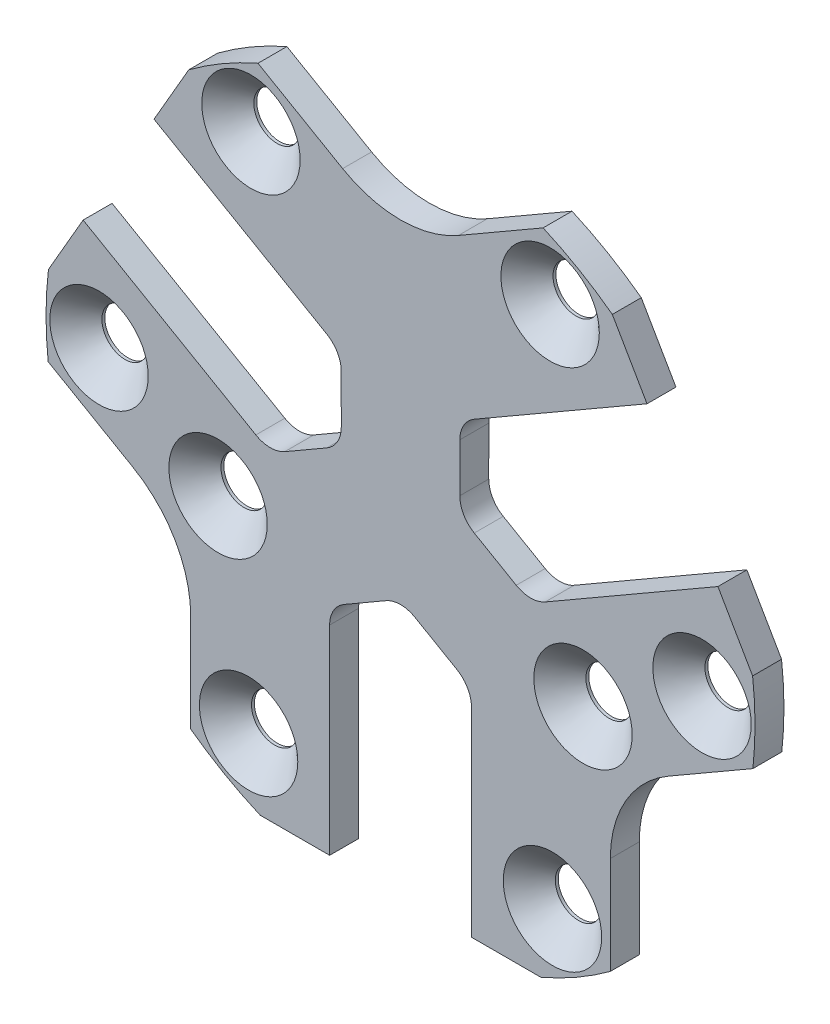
ISO-10303-21;
HEADER;
FILE_DESCRIPTION(('STEP AP214'),'2;1');
FILE_NAME('part.step','',(''),(''),'','','');
FILE_SCHEMA(('AUTOMOTIVE_DESIGN { 1 0 10303 214 1 1 1 1 }'));
ENDSEC;
DATA;
#1=APPLICATION_CONTEXT('core data for automotive mechanical design processes');
#2=APPLICATION_PROTOCOL_DEFINITION('international standard','automotive_design',2000,#1);
#3=PRODUCT_CONTEXT('',#1,'mechanical');
#4=PRODUCT('Part','Part','',(#3));
#5=PRODUCT_RELATED_PRODUCT_CATEGORY('part','',(#4));
#6=PRODUCT_DEFINITION_FORMATION('','',#4);
#7=PRODUCT_DEFINITION_CONTEXT('part definition',#1,'design');
#8=PRODUCT_DEFINITION('design','',#6,#7);
#9=PRODUCT_DEFINITION_SHAPE('','',#8);
#10=(LENGTH_UNIT() NAMED_UNIT(*) SI_UNIT(.MILLI.,.METRE.));
#11=(NAMED_UNIT(*) PLANE_ANGLE_UNIT() SI_UNIT($,.RADIAN.));
#12=(NAMED_UNIT(*) SI_UNIT($,.STERADIAN.) SOLID_ANGLE_UNIT());
#13=UNCERTAINTY_MEASURE_WITH_UNIT(LENGTH_MEASURE(1.E-05),#10,'distance_accuracy_value','');
#14=(GEOMETRIC_REPRESENTATION_CONTEXT(3) GLOBAL_UNCERTAINTY_ASSIGNED_CONTEXT((#13)) GLOBAL_UNIT_ASSIGNED_CONTEXT((#10,
#11,#12)) REPRESENTATION_CONTEXT('',''));
#15=CARTESIAN_POINT('',(0.,0.,0.));
#16=DIRECTION('',(0.,0.,1.));
#17=DIRECTION('',(1.,0.,0.));
#18=AXIS2_PLACEMENT_3D('',#15,#16,#17);
#19=CARTESIAN_POINT('',(-22.5,-12.9903810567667,2.));
#20=DIRECTION('',(0.,0.,-1.));
#21=DIRECTION('',(-1.,0.,0.));
#22=AXIS2_PLACEMENT_3D('',#19,#20,#21);
#23=CYLINDRICAL_SURFACE('',#22,8.);
#24=CARTESIAN_POINT('',(-22.5,-12.9903810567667,0.));
#25=DIRECTION('',(0.,0.,-1.));
#26=DIRECTION('',(1.,0.,0.));
#27=AXIS2_PLACEMENT_3D('',#24,#25,#26);
#28=CIRCLE('',#27,8.);
#29=CARTESIAN_POINT('',(-18.5000000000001,-6.06217782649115,0.));
#30=VERTEX_POINT('',#29);
#31=CARTESIAN_POINT('',(-14.5,-12.9903810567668,0.));
#32=VERTEX_POINT('',#31);
#33=EDGE_CURVE('E622',#30,#32,#28,.T.);
#34=ORIENTED_EDGE('',*,*,#33,.T.);
#35=DIRECTION('',(0.,0.,-1.));
#36=VECTOR('',#35,1.);
#37=CARTESIAN_POINT('',(-14.5,-12.9903810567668,2.));
#38=LINE('',#37,#36);
#39=CARTESIAN_POINT('',(-14.5,-12.9903810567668,2.));
#40=VERTEX_POINT('',#39);
#41=EDGE_CURVE('E11',#40,#32,#38,.T.);
#42=ORIENTED_EDGE('',*,*,#41,.F.);
#43=CARTESIAN_POINT('',(-22.5,-12.9903810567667,2.));
#44=DIRECTION('',(0.,0.,-1.));
#45=DIRECTION('',(1.,0.,0.));
#46=AXIS2_PLACEMENT_3D('',#43,#44,#45);
#47=CIRCLE('',#46,8.);
#48=CARTESIAN_POINT('',(-18.5000000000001,-6.06217782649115,2.));
#49=VERTEX_POINT('',#48);
#50=EDGE_CURVE('E722',#49,#40,#47,.T.);
#51=ORIENTED_EDGE('',*,*,#50,.F.);
#52=DIRECTION('',(0.,0.,-1.));
#53=VECTOR('',#52,1.);
#54=CARTESIAN_POINT('',(-18.5000000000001,-6.06217782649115,2.));
#55=LINE('',#54,#53);
#56=EDGE_CURVE('E635',#49,#30,#55,.T.);
#57=ORIENTED_EDGE('',*,*,#56,.T.);
#58=EDGE_LOOP('',(#34,#42,#51,#57));
#59=FACE_BOUND('',#58,.T.);
#60=ADVANCED_FACE('F350',(#59),#23,.F.);
#61=CARTESIAN_POINT('',(-14.5,-19.7484176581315,2.));
#62=DIRECTION('',(1.,0.,0.));
#63=DIRECTION('',(0.,1.,0.));
#64=AXIS2_PLACEMENT_3D('',#61,#62,#63);
#65=PLANE('',#64);
#66=DIRECTION('',(0.,-1.,0.));
#67=VECTOR('',#66,1.);
#68=CARTESIAN_POINT('',(-14.5,-19.7484176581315,0.));
#69=LINE('',#68,#67);
#70=CARTESIAN_POINT('',(-14.5,-19.7484176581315,0.));
#71=VERTEX_POINT('',#70);
#72=EDGE_CURVE('E618',#32,#71,#69,.T.);
#73=ORIENTED_EDGE('',*,*,#72,.T.);
#74=DIRECTION('',(0.,0.,-1.));
#75=VECTOR('',#74,1.);
#76=CARTESIAN_POINT('',(-14.5,-19.7484176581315,2.));
#77=LINE('',#76,#75);
#78=CARTESIAN_POINT('',(-14.5,-19.7484176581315,2.));
#79=VERTEX_POINT('',#78);
#80=EDGE_CURVE('E357',#79,#71,#77,.T.);
#81=ORIENTED_EDGE('',*,*,#80,.F.);
#82=DIRECTION('',(0.,-1.,0.));
#83=VECTOR('',#82,1.);
#84=CARTESIAN_POINT('',(-14.5,-19.7484176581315,2.));
#85=LINE('',#84,#83);
#86=EDGE_CURVE('E631',#40,#79,#85,.T.);
#87=ORIENTED_EDGE('',*,*,#86,.F.);
#88=ORIENTED_EDGE('',*,*,#41,.T.);
#89=EDGE_LOOP('',(#73,#81,#87,#88));
#90=FACE_BOUND('',#89,.T.);
#91=ADVANCED_FACE('F630',(#90),#65,.F.);
#92=CARTESIAN_POINT('',(0.,0.,2.));
#93=DIRECTION('',(0.,0.,-1.));
#94=DIRECTION('',(-1.,0.,0.));
#95=AXIS2_PLACEMENT_3D('',#92,#93,#94);
#96=CYLINDRICAL_SURFACE('',#95,24.5);
#97=CARTESIAN_POINT('',(0.,0.,0.));
#98=DIRECTION('',(0.,0.,1.));
#99=DIRECTION('',(1.,0.,0.));
#100=AXIS2_PLACEMENT_3D('',#97,#98,#99);
#101=CIRCLE('',#100,24.5);
#102=CARTESIAN_POINT('',(-9.69535971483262,-22.5,0.));
#103=VERTEX_POINT('',#102);
#104=EDGE_CURVE('E624',#71,#103,#101,.T.);
#105=ORIENTED_EDGE('',*,*,#104,.T.);
#106=DIRECTION('',(0.,0.,-1.));
#107=VECTOR('',#106,1.);
#108=CARTESIAN_POINT('',(-9.69535971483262,-22.5,2.));
#109=LINE('',#108,#107);
#110=CARTESIAN_POINT('',(-9.69535971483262,-22.5,2.));
#111=VERTEX_POINT('',#110);
#112=EDGE_CURVE('E918',#111,#103,#109,.T.);
#113=ORIENTED_EDGE('',*,*,#112,.F.);
#114=CARTESIAN_POINT('',(0.,0.,2.));
#115=DIRECTION('',(0.,0.,1.));
#116=DIRECTION('',(1.,0.,0.));
#117=AXIS2_PLACEMENT_3D('',#114,#115,#116);
#118=CIRCLE('',#117,24.5);
#119=EDGE_CURVE('E725',#79,#111,#118,.T.);
#120=ORIENTED_EDGE('',*,*,#119,.F.);
#121=ORIENTED_EDGE('',*,*,#80,.T.);
#122=EDGE_LOOP('',(#105,#113,#120,#121));
#123=FACE_BOUND('',#122,.T.);
#124=ADVANCED_FACE('F922',(#123),#96,.T.);
#125=CARTESIAN_POINT('',(-9.69535971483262,-22.5,2.));
#126=DIRECTION('',(0.,1.,0.));
#127=DIRECTION('',(0.,0.,1.));
#128=AXIS2_PLACEMENT_3D('',#125,#126,#127);
#129=PLANE('',#128);
#130=DIRECTION('',(1.,0.,0.));
#131=VECTOR('',#130,1.);
#132=CARTESIAN_POINT('',(-9.69535971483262,-22.5,0.));
#133=LINE('',#132,#131);
#134=CARTESIAN_POINT('',(-4.9,-22.5,0.));
#135=VERTEX_POINT('',#134);
#136=EDGE_CURVE('E644',#103,#135,#133,.T.);
#137=ORIENTED_EDGE('',*,*,#136,.T.);
#138=DIRECTION('',(0.,0.,-1.));
#139=VECTOR('',#138,1.);
#140=CARTESIAN_POINT('',(-4.9,-22.5,2.));
#141=LINE('',#140,#139);
#142=CARTESIAN_POINT('',(-4.9,-22.5,2.));
#143=VERTEX_POINT('',#142);
#144=EDGE_CURVE('E915',#143,#135,#141,.T.);
#145=ORIENTED_EDGE('',*,*,#144,.F.);
#146=DIRECTION('',(1.,0.,0.));
#147=VECTOR('',#146,1.);
#148=CARTESIAN_POINT('',(-9.69535971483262,-22.5,2.));
#149=LINE('',#148,#147);
#150=EDGE_CURVE('E727',#111,#143,#149,.T.);
#151=ORIENTED_EDGE('',*,*,#150,.F.);
#152=ORIENTED_EDGE('',*,*,#112,.T.);
#153=EDGE_LOOP('',(#137,#145,#151,#152));
#154=FACE_BOUND('',#153,.T.);
#155=ADVANCED_FACE('F930',(#154),#129,.F.);
#156=CARTESIAN_POINT('',(-4.9,-8.715,2.));
#157=DIRECTION('',(-1.,0.,0.));
#158=DIRECTION('',(0.,0.,1.));
#159=AXIS2_PLACEMENT_3D('',#156,#157,#158);
#160=PLANE('',#159);
#161=DIRECTION('',(0.,1.,0.));
#162=VECTOR('',#161,1.);
#163=CARTESIAN_POINT('',(-4.9,-8.715,0.));
#164=LINE('',#163,#162);
#165=CARTESIAN_POINT('',(-4.9,-8.715,0.));
#166=VERTEX_POINT('',#165);
#167=EDGE_CURVE('E646',#135,#166,#164,.T.);
#168=ORIENTED_EDGE('',*,*,#167,.T.);
#169=DIRECTION('',(0.,0.,-1.));
#170=VECTOR('',#169,1.);
#171=CARTESIAN_POINT('',(-4.9,-8.715,2.));
#172=LINE('',#171,#170);
#173=CARTESIAN_POINT('',(-4.9,-8.715,2.));
#174=VERTEX_POINT('',#173);
#175=EDGE_CURVE('E912',#174,#166,#172,.T.);
#176=ORIENTED_EDGE('',*,*,#175,.F.);
#177=DIRECTION('',(0.,1.,0.));
#178=VECTOR('',#177,1.);
#179=CARTESIAN_POINT('',(-4.9,-8.715,2.));
#180=LINE('',#179,#178);
#181=EDGE_CURVE('E729',#143,#174,#180,.T.);
#182=ORIENTED_EDGE('',*,*,#181,.F.);
#183=ORIENTED_EDGE('',*,*,#144,.T.);
#184=EDGE_LOOP('',(#168,#176,#182,#183));
#185=FACE_BOUND('',#184,.T.);
#186=ADVANCED_FACE('F933',(#185),#160,.F.);
#187=CARTESIAN_POINT('',(-2.9,-8.715,2.));
#188=DIRECTION('',(0.,0.,-1.));
#189=DIRECTION('',(-1.,0.,0.));
#190=AXIS2_PLACEMENT_3D('',#187,#188,#189);
#191=CYLINDRICAL_SURFACE('',#190,2.);
#192=CARTESIAN_POINT('',(-2.9,-8.715,0.));
#193=DIRECTION('',(0.,0.,-1.));
#194=DIRECTION('',(1.,0.,0.));
#195=AXIS2_PLACEMENT_3D('',#192,#193,#194);
#196=CIRCLE('',#195,2.);
#197=CARTESIAN_POINT('',(-3.90030644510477,-6.98312615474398,0.));
#198=VERTEX_POINT('',#197);
#199=EDGE_CURVE('E648',#166,#198,#196,.T.);
#200=ORIENTED_EDGE('',*,*,#199,.T.);
#201=DIRECTION('',(0.,0.,-1.));
#202=VECTOR('',#201,1.);
#203=CARTESIAN_POINT('',(-3.90030644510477,-6.98312615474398,2.));
#204=LINE('',#203,#202);
#205=CARTESIAN_POINT('',(-3.90030644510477,-6.98312615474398,2.));
#206=VERTEX_POINT('',#205);
#207=EDGE_CURVE('E909',#206,#198,#204,.T.);
#208=ORIENTED_EDGE('',*,*,#207,.F.);
#209=CARTESIAN_POINT('',(-2.9,-8.715,2.));
#210=DIRECTION('',(0.,0.,-1.));
#211=DIRECTION('',(1.,0.,0.));
#212=AXIS2_PLACEMENT_3D('',#209,#210,#211);
#213=CIRCLE('',#212,2.);
#214=EDGE_CURVE('E731',#174,#206,#213,.T.);
#215=ORIENTED_EDGE('',*,*,#214,.F.);
#216=ORIENTED_EDGE('',*,*,#175,.T.);
#217=EDGE_LOOP('',(#200,#208,#215,#216));
#218=FACE_BOUND('',#217,.T.);
#219=ADVANCED_FACE('F938',(#218),#191,.F.);
#220=CARTESIAN_POINT('',(-3.90030644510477,-6.98312615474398,2.));
#221=DIRECTION('',(-0.500153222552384,0.865936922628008,0.));
#222=DIRECTION('',(-0.865936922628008,-0.500153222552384,0.));
#223=AXIS2_PLACEMENT_3D('',#220,#221,#222);
#224=PLANE('',#223);
#225=DIRECTION('',(0.865936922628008,0.500153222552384,0.));
#226=VECTOR('',#225,1.);
#227=CARTESIAN_POINT('',(-3.90030644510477,-6.98312615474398,0.));
#228=LINE('',#227,#226);
#229=CARTESIAN_POINT('',(-1.00030644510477,-5.30812615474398,0.));
#230=VERTEX_POINT('',#229);
#231=EDGE_CURVE('E650',#198,#230,#228,.T.);
#232=ORIENTED_EDGE('',*,*,#231,.T.);
#233=DIRECTION('',(0.,0.,-1.));
#234=VECTOR('',#233,1.);
#235=CARTESIAN_POINT('',(-1.00030644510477,-5.30812615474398,2.));
#236=LINE('',#235,#234);
#237=CARTESIAN_POINT('',(-1.00030644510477,-5.30812615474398,2.));
#238=VERTEX_POINT('',#237);
#239=EDGE_CURVE('E906',#238,#230,#236,.T.);
#240=ORIENTED_EDGE('',*,*,#239,.F.);
#241=DIRECTION('',(0.865936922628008,0.500153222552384,0.));
#242=VECTOR('',#241,1.);
#243=CARTESIAN_POINT('',(-3.90030644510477,-6.98312615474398,2.));
#244=LINE('',#243,#242);
#245=EDGE_CURVE('E733',#206,#238,#244,.T.);
#246=ORIENTED_EDGE('',*,*,#245,.F.);
#247=ORIENTED_EDGE('',*,*,#207,.T.);
#248=EDGE_LOOP('',(#232,#240,#246,#247));
#249=FACE_BOUND('',#248,.T.);
#250=ADVANCED_FACE('F944',(#249),#224,.F.);
#251=CARTESIAN_POINT('',(0.,-7.04,2.));
#252=DIRECTION('',(0.,0.,-1.));
#253=DIRECTION('',(-1.,0.,0.));
#254=AXIS2_PLACEMENT_3D('',#251,#252,#253);
#255=CYLINDRICAL_SURFACE('',#254,2.);
#256=CARTESIAN_POINT('',(0.,-7.04,0.));
#257=DIRECTION('',(0.,0.,-1.));
#258=DIRECTION('',(1.,0.,0.));
#259=AXIS2_PLACEMENT_3D('',#256,#257,#258);
#260=CIRCLE('',#259,2.);
#261=CARTESIAN_POINT('',(1.00030644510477,-5.30812615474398,0.));
#262=VERTEX_POINT('',#261);
#263=EDGE_CURVE('E652',#230,#262,#260,.T.);
#264=ORIENTED_EDGE('',*,*,#263,.T.);
#265=DIRECTION('',(0.,0.,-1.));
#266=VECTOR('',#265,1.);
#267=CARTESIAN_POINT('',(1.00030644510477,-5.30812615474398,2.));
#268=LINE('',#267,#266);
#269=CARTESIAN_POINT('',(1.00030644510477,-5.30812615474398,2.));
#270=VERTEX_POINT('',#269);
#271=EDGE_CURVE('E903',#270,#262,#268,.T.);
#272=ORIENTED_EDGE('',*,*,#271,.F.);
#273=CARTESIAN_POINT('',(0.,-7.04,2.));
#274=DIRECTION('',(0.,0.,-1.));
#275=DIRECTION('',(1.,0.,0.));
#276=AXIS2_PLACEMENT_3D('',#273,#274,#275);
#277=CIRCLE('',#276,2.);
#278=EDGE_CURVE('E735',#238,#270,#277,.T.);
#279=ORIENTED_EDGE('',*,*,#278,.F.);
#280=ORIENTED_EDGE('',*,*,#239,.T.);
#281=EDGE_LOOP('',(#264,#272,#279,#280));
#282=FACE_BOUND('',#281,.T.);
#283=ADVANCED_FACE('F948',(#282),#255,.F.);
#284=CARTESIAN_POINT('',(1.00030644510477,-5.30812615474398,2.));
#285=DIRECTION('',(0.500153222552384,0.865936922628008,0.));
#286=DIRECTION('',(-0.865936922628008,0.500153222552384,0.));
#287=AXIS2_PLACEMENT_3D('',#284,#285,#286);
#288=PLANE('',#287);
#289=DIRECTION('',(0.865936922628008,-0.500153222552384,0.));
#290=VECTOR('',#289,1.);
#291=CARTESIAN_POINT('',(1.00030644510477,-5.30812615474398,0.));
#292=LINE('',#291,#290);
#293=CARTESIAN_POINT('',(3.90030644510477,-6.98312615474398,0.));
#294=VERTEX_POINT('',#293);
#295=EDGE_CURVE('E654',#262,#294,#292,.T.);
#296=ORIENTED_EDGE('',*,*,#295,.T.);
#297=DIRECTION('',(0.,0.,-1.));
#298=VECTOR('',#297,1.);
#299=CARTESIAN_POINT('',(3.90030644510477,-6.98312615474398,2.));
#300=LINE('',#299,#298);
#301=CARTESIAN_POINT('',(3.90030644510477,-6.98312615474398,2.));
#302=VERTEX_POINT('',#301);
#303=EDGE_CURVE('E900',#302,#294,#300,.T.);
#304=ORIENTED_EDGE('',*,*,#303,.F.);
#305=DIRECTION('',(0.865936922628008,-0.500153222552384,0.));
#306=VECTOR('',#305,1.);
#307=CARTESIAN_POINT('',(1.00030644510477,-5.30812615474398,2.));
#308=LINE('',#307,#306);
#309=EDGE_CURVE('E737',#270,#302,#308,.T.);
#310=ORIENTED_EDGE('',*,*,#309,.F.);
#311=ORIENTED_EDGE('',*,*,#271,.T.);
#312=EDGE_LOOP('',(#296,#304,#310,#311));
#313=FACE_BOUND('',#312,.T.);
#314=ADVANCED_FACE('F953',(#313),#288,.F.);
#315=CARTESIAN_POINT('',(2.9,-8.715,2.));
#316=DIRECTION('',(0.,0.,-1.));
#317=DIRECTION('',(-1.,0.,0.));
#318=AXIS2_PLACEMENT_3D('',#315,#316,#317);
#319=CYLINDRICAL_SURFACE('',#318,2.);
#320=CARTESIAN_POINT('',(2.9,-8.715,0.));
#321=DIRECTION('',(0.,0.,-1.));
#322=DIRECTION('',(1.,0.,0.));
#323=AXIS2_PLACEMENT_3D('',#320,#321,#322);
#324=CIRCLE('',#323,2.);
#325=CARTESIAN_POINT('',(4.9,-8.715,0.));
#326=VERTEX_POINT('',#325);
#327=EDGE_CURVE('E656',#294,#326,#324,.T.);
#328=ORIENTED_EDGE('',*,*,#327,.T.);
#329=DIRECTION('',(0.,0.,-1.));
#330=VECTOR('',#329,1.);
#331=CARTESIAN_POINT('',(4.9,-8.715,2.));
#332=LINE('',#331,#330);
#333=CARTESIAN_POINT('',(4.9,-8.715,2.));
#334=VERTEX_POINT('',#333);
#335=EDGE_CURVE('E897',#334,#326,#332,.T.);
#336=ORIENTED_EDGE('',*,*,#335,.F.);
#337=CARTESIAN_POINT('',(2.9,-8.715,2.));
#338=DIRECTION('',(0.,0.,-1.));
#339=DIRECTION('',(1.,0.,0.));
#340=AXIS2_PLACEMENT_3D('',#337,#338,#339);
#341=CIRCLE('',#340,2.);
#342=EDGE_CURVE('E739',#302,#334,#341,.T.);
#343=ORIENTED_EDGE('',*,*,#342,.F.);
#344=ORIENTED_EDGE('',*,*,#303,.T.);
#345=EDGE_LOOP('',(#328,#336,#343,#344));
#346=FACE_BOUND('',#345,.T.);
#347=ADVANCED_FACE('F959',(#346),#319,.F.);
#348=CARTESIAN_POINT('',(4.9,-8.715,2.));
#349=DIRECTION('',(1.,0.,0.));
#350=DIRECTION('',(0.,1.,0.));
#351=AXIS2_PLACEMENT_3D('',#348,#349,#350);
#352=PLANE('',#351);
#353=DIRECTION('',(0.,-1.,0.));
#354=VECTOR('',#353,1.);
#355=CARTESIAN_POINT('',(4.9,-8.715,0.));
#356=LINE('',#355,#354);
#357=CARTESIAN_POINT('',(4.9,-22.5,0.));
#358=VERTEX_POINT('',#357);
#359=EDGE_CURVE('E658',#326,#358,#356,.T.);
#360=ORIENTED_EDGE('',*,*,#359,.T.);
#361=DIRECTION('',(0.,0.,-1.));
#362=VECTOR('',#361,1.);
#363=CARTESIAN_POINT('',(4.9,-22.5,2.));
#364=LINE('',#363,#362);
#365=CARTESIAN_POINT('',(4.9,-22.5,2.));
#366=VERTEX_POINT('',#365);
#367=EDGE_CURVE('E894',#366,#358,#364,.T.);
#368=ORIENTED_EDGE('',*,*,#367,.F.);
#369=DIRECTION('',(0.,-1.,0.));
#370=VECTOR('',#369,1.);
#371=CARTESIAN_POINT('',(4.9,-8.715,2.));
#372=LINE('',#371,#370);
#373=EDGE_CURVE('E741',#334,#366,#372,.T.);
#374=ORIENTED_EDGE('',*,*,#373,.F.);
#375=ORIENTED_EDGE('',*,*,#335,.T.);
#376=EDGE_LOOP('',(#360,#368,#374,#375));
#377=FACE_BOUND('',#376,.T.);
#378=ADVANCED_FACE('F963',(#377),#352,.F.);
#379=CARTESIAN_POINT('',(4.9,-22.5,2.));
#380=DIRECTION('',(0.,1.,0.));
#381=DIRECTION('',(0.,0.,1.));
#382=AXIS2_PLACEMENT_3D('',#379,#380,#381);
#383=PLANE('',#382);
#384=DIRECTION('',(1.,0.,0.));
#385=VECTOR('',#384,1.);
#386=CARTESIAN_POINT('',(4.9,-22.5,0.));
#387=LINE('',#386,#385);
#388=CARTESIAN_POINT('',(9.69535971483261,-22.5,0.));
#389=VERTEX_POINT('',#388);
#390=EDGE_CURVE('E660',#358,#389,#387,.T.);
#391=ORIENTED_EDGE('',*,*,#390,.T.);
#392=DIRECTION('',(0.,0.,-1.));
#393=VECTOR('',#392,1.);
#394=CARTESIAN_POINT('',(9.69535971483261,-22.5,2.));
#395=LINE('',#394,#393);
#396=CARTESIAN_POINT('',(9.69535971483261,-22.5,2.));
#397=VERTEX_POINT('',#396);
#398=EDGE_CURVE('E891',#397,#389,#395,.T.);
#399=ORIENTED_EDGE('',*,*,#398,.F.);
#400=DIRECTION('',(1.,0.,0.));
#401=VECTOR('',#400,1.);
#402=CARTESIAN_POINT('',(4.9,-22.5,2.));
#403=LINE('',#402,#401);
#404=EDGE_CURVE('E743',#366,#397,#403,.T.);
#405=ORIENTED_EDGE('',*,*,#404,.F.);
#406=ORIENTED_EDGE('',*,*,#367,.T.);
#407=EDGE_LOOP('',(#391,#399,#405,#406));
#408=FACE_BOUND('',#407,.T.);
#409=ADVANCED_FACE('F968',(#408),#383,.F.);
#410=CARTESIAN_POINT('',(0.,0.,2.));
#411=DIRECTION('',(0.,0.,-1.));
#412=DIRECTION('',(-1.,0.,0.));
#413=AXIS2_PLACEMENT_3D('',#410,#411,#412);
#414=CYLINDRICAL_SURFACE('',#413,24.5);
#415=CARTESIAN_POINT('',(0.,0.,0.));
#416=DIRECTION('',(0.,0.,1.));
#417=DIRECTION('',(1.,0.,0.));
#418=AXIS2_PLACEMENT_3D('',#415,#416,#417);
#419=CIRCLE('',#418,24.5);
#420=CARTESIAN_POINT('',(14.5,-19.7484176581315,0.));
#421=VERTEX_POINT('',#420);
#422=EDGE_CURVE('E662',#389,#421,#419,.T.);
#423=ORIENTED_EDGE('',*,*,#422,.T.);
#424=DIRECTION('',(0.,0.,-1.));
#425=VECTOR('',#424,1.);
#426=CARTESIAN_POINT('',(14.5,-19.7484176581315,2.));
#427=LINE('',#426,#425);
#428=CARTESIAN_POINT('',(14.5,-19.7484176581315,2.));
#429=VERTEX_POINT('',#428);
#430=EDGE_CURVE('E888',#429,#421,#427,.T.);
#431=ORIENTED_EDGE('',*,*,#430,.F.);
#432=CARTESIAN_POINT('',(0.,0.,2.));
#433=DIRECTION('',(0.,0.,1.));
#434=DIRECTION('',(1.,0.,0.));
#435=AXIS2_PLACEMENT_3D('',#432,#433,#434);
#436=CIRCLE('',#435,24.5);
#437=EDGE_CURVE('E745',#397,#429,#436,.T.);
#438=ORIENTED_EDGE('',*,*,#437,.F.);
#439=ORIENTED_EDGE('',*,*,#398,.T.);
#440=EDGE_LOOP('',(#423,#431,#438,#439));
#441=FACE_BOUND('',#440,.T.);
#442=ADVANCED_FACE('F974',(#441),#414,.T.);
#443=CARTESIAN_POINT('',(14.5,-12.9903810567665,2.));
#444=DIRECTION('',(-1.,0.,0.));
#445=DIRECTION('',(0.,-1.,0.));
#446=AXIS2_PLACEMENT_3D('',#443,#444,#445);
#447=PLANE('',#446);
#448=DIRECTION('',(0.,1.,0.));
#449=VECTOR('',#448,1.);
#450=CARTESIAN_POINT('',(14.5,-12.9903810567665,0.));
#451=LINE('',#450,#449);
#452=CARTESIAN_POINT('',(14.5,-12.9903810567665,0.));
#453=VERTEX_POINT('',#452);
#454=EDGE_CURVE('E664',#421,#453,#451,.T.);
#455=ORIENTED_EDGE('',*,*,#454,.T.);
#456=DIRECTION('',(0.,0.,-1.));
#457=VECTOR('',#456,1.);
#458=CARTESIAN_POINT('',(14.5,-12.9903810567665,2.));
#459=LINE('',#458,#457);
#460=CARTESIAN_POINT('',(14.5,-12.9903810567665,2.));
#461=VERTEX_POINT('',#460);
#462=EDGE_CURVE('E885',#461,#453,#459,.T.);
#463=ORIENTED_EDGE('',*,*,#462,.F.);
#464=DIRECTION('',(0.,1.,0.));
#465=VECTOR('',#464,1.);
#466=CARTESIAN_POINT('',(14.5,-12.9903810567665,2.));
#467=LINE('',#466,#465);
#468=EDGE_CURVE('E747',#429,#461,#467,.T.);
#469=ORIENTED_EDGE('',*,*,#468,.F.);
#470=ORIENTED_EDGE('',*,*,#430,.T.);
#471=EDGE_LOOP('',(#455,#463,#469,#470));
#472=FACE_BOUND('',#471,.T.);
#473=ADVANCED_FACE('F978',(#472),#447,.F.);
#474=CARTESIAN_POINT('',(22.5,-12.9903810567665,2.));
#475=DIRECTION('',(0.,0.,-1.));
#476=DIRECTION('',(-1.,0.,0.));
#477=AXIS2_PLACEMENT_3D('',#474,#475,#476);
#478=CYLINDRICAL_SURFACE('',#477,8.);
#479=CARTESIAN_POINT('',(22.5,-12.9903810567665,0.));
#480=DIRECTION('',(0.,0.,-1.));
#481=DIRECTION('',(1.,0.,0.));
#482=AXIS2_PLACEMENT_3D('',#479,#480,#481);
#483=CIRCLE('',#482,8.);
#484=CARTESIAN_POINT('',(18.5,-6.062177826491,0.));
#485=VERTEX_POINT('',#484);
#486=EDGE_CURVE('E666',#453,#485,#483,.T.);
#487=ORIENTED_EDGE('',*,*,#486,.T.);
#488=DIRECTION('',(0.,0.,-1.));
#489=VECTOR('',#488,1.);
#490=CARTESIAN_POINT('',(18.5,-6.062177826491,2.));
#491=LINE('',#490,#489);
#492=CARTESIAN_POINT('',(18.5,-6.062177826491,2.));
#493=VERTEX_POINT('',#492);
#494=EDGE_CURVE('E882',#493,#485,#491,.T.);
#495=ORIENTED_EDGE('',*,*,#494,.F.);
#496=CARTESIAN_POINT('',(22.5,-12.9903810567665,2.));
#497=DIRECTION('',(0.,0.,-1.));
#498=DIRECTION('',(1.,0.,0.));
#499=AXIS2_PLACEMENT_3D('',#496,#497,#498);
#500=CIRCLE('',#499,8.);
#501=EDGE_CURVE('E749',#461,#493,#500,.T.);
#502=ORIENTED_EDGE('',*,*,#501,.F.);
#503=ORIENTED_EDGE('',*,*,#462,.T.);
#504=EDGE_LOOP('',(#487,#495,#502,#503));
#505=FACE_BOUND('',#504,.T.);
#506=ADVANCED_FACE('F983',(#505),#478,.F.);
#507=CARTESIAN_POINT('',(24.352631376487,-2.68315952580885,2.));
#508=DIRECTION('',(-0.499999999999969,0.866025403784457,0.));
#509=DIRECTION('',(-0.866025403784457,-0.499999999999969,0.));
#510=AXIS2_PLACEMENT_3D('',#507,#508,#509);
#511=PLANE('',#510);
#512=DIRECTION('',(0.866025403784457,0.499999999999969,0.));
#513=VECTOR('',#512,1.);
#514=CARTESIAN_POINT('',(24.352631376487,-2.68315952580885,0.));
#515=LINE('',#514,#513);
#516=CARTESIAN_POINT('',(24.352631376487,-2.68315952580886,0.));
#517=VERTEX_POINT('',#516);
#518=EDGE_CURVE('E668',#485,#517,#515,.T.);
#519=ORIENTED_EDGE('',*,*,#518,.T.);
#520=DIRECTION('',(0.,0.,-1.));
#521=VECTOR('',#520,1.);
#522=CARTESIAN_POINT('',(24.352631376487,-2.68315952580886,2.));
#523=LINE('',#522,#521);
#524=CARTESIAN_POINT('',(24.352631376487,-2.68315952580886,2.));
#525=VERTEX_POINT('',#524);
#526=EDGE_CURVE('E879',#525,#517,#523,.T.);
#527=ORIENTED_EDGE('',*,*,#526,.F.);
#528=DIRECTION('',(0.866025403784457,0.499999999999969,0.));
#529=VECTOR('',#528,1.);
#530=CARTESIAN_POINT('',(24.352631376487,-2.68315952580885,2.));
#531=LINE('',#530,#529);
#532=EDGE_CURVE('E751',#493,#525,#531,.T.);
#533=ORIENTED_EDGE('',*,*,#532,.F.);
#534=ORIENTED_EDGE('',*,*,#494,.T.);
#535=EDGE_LOOP('',(#519,#527,#533,#534));
#536=FACE_BOUND('',#535,.T.);
#537=ADVANCED_FACE('F989',(#536),#511,.F.);
#538=CARTESIAN_POINT('',(0.,0.,2.));
#539=DIRECTION('',(0.,0.,-1.));
#540=DIRECTION('',(-1.,0.,0.));
#541=AXIS2_PLACEMENT_3D('',#538,#539,#540);
#542=CYLINDRICAL_SURFACE('',#541,24.5);
#543=CARTESIAN_POINT('',(0.,0.,0.));
#544=DIRECTION('',(0.,0.,1.));
#545=DIRECTION('',(1.,0.,0.));
#546=AXIS2_PLACEMENT_3D('',#543,#544,#545);
#547=CIRCLE('',#546,24.5);
#548=CARTESIAN_POINT('',(24.3332514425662,2.85357218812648,0.));
#549=VERTEX_POINT('',#548);
#550=EDGE_CURVE('E670',#517,#549,#547,.T.);
#551=ORIENTED_EDGE('',*,*,#550,.T.);
#552=DIRECTION('',(0.,0.,-1.));
#553=VECTOR('',#552,1.);
#554=CARTESIAN_POINT('',(24.3332514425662,2.85357218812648,2.));
#555=LINE('',#554,#553);
#556=CARTESIAN_POINT('',(24.3332514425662,2.85357218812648,2.));
#557=VERTEX_POINT('',#556);
#558=EDGE_CURVE('E876',#557,#549,#555,.T.);
#559=ORIENTED_EDGE('',*,*,#558,.F.);
#560=CARTESIAN_POINT('',(0.,0.,2.));
#561=DIRECTION('',(0.,0.,1.));
#562=DIRECTION('',(1.,0.,0.));
#563=AXIS2_PLACEMENT_3D('',#560,#561,#562);
#564=CIRCLE('',#563,24.5);
#565=EDGE_CURVE('E753',#525,#557,#564,.T.);
#566=ORIENTED_EDGE('',*,*,#565,.F.);
#567=ORIENTED_EDGE('',*,*,#526,.T.);
#568=EDGE_LOOP('',(#551,#559,#566,#567));
#569=FACE_BOUND('',#568,.T.);
#570=ADVANCED_FACE('F993',(#569),#542,.T.);
#571=CARTESIAN_POINT('',(24.3332514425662,2.85357218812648,2.));
#572=DIRECTION('',(-0.866025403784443,-0.499999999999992,0.));
#573=DIRECTION('',(0.499999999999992,-0.866025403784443,0.));
#574=AXIS2_PLACEMENT_3D('',#571,#572,#573);
#575=PLANE('',#574);
#576=DIRECTION('',(-0.499999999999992,0.866025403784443,0.));
#577=VECTOR('',#576,1.);
#578=CARTESIAN_POINT('',(24.3332514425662,2.85357218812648,0.));
#579=LINE('',#578,#577);
#580=CARTESIAN_POINT('',(21.9355715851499,7.00647552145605,0.));
#581=VERTEX_POINT('',#580);
#582=EDGE_CURVE('E672',#549,#581,#579,.T.);
#583=ORIENTED_EDGE('',*,*,#582,.T.);
#584=DIRECTION('',(0.,0.,-1.));
#585=VECTOR('',#584,1.);
#586=CARTESIAN_POINT('',(21.9355715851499,7.00647552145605,2.));
#587=LINE('',#586,#585);
#588=CARTESIAN_POINT('',(21.9355715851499,7.00647552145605,2.));
#589=VERTEX_POINT('',#588);
#590=EDGE_CURVE('E873',#589,#581,#587,.T.);
#591=ORIENTED_EDGE('',*,*,#590,.F.);
#592=DIRECTION('',(-0.499999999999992,0.866025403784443,0.));
#593=VECTOR('',#592,1.);
#594=CARTESIAN_POINT('',(24.3332514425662,2.85357218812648,2.));
#595=LINE('',#594,#593);
#596=EDGE_CURVE('E755',#557,#589,#595,.T.);
#597=ORIENTED_EDGE('',*,*,#596,.F.);
#598=ORIENTED_EDGE('',*,*,#558,.T.);
#599=EDGE_LOOP('',(#583,#591,#597,#598));
#600=FACE_BOUND('',#599,.T.);
#601=ADVANCED_FACE('F998',(#600),#575,.F.);
#602=CARTESIAN_POINT('',(9.99741139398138,0.113975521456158,2.));
#603=DIRECTION('',(0.499999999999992,-0.866025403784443,0.));
#604=DIRECTION('',(0.866025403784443,0.499999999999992,0.));
#605=AXIS2_PLACEMENT_3D('',#602,#603,#604);
#606=PLANE('',#605);
#607=DIRECTION('',(-0.866025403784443,-0.499999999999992,0.));
#608=VECTOR('',#607,1.);
#609=CARTESIAN_POINT('',(9.99741139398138,0.113975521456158,0.));
#610=LINE('',#609,#608);
#611=CARTESIAN_POINT('',(9.99741139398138,0.113975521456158,0.));
#612=VERTEX_POINT('',#611);
#613=EDGE_CURVE('E674',#581,#612,#610,.T.);
#614=ORIENTED_EDGE('',*,*,#613,.T.);
#615=DIRECTION('',(0.,0.,-1.));
#616=VECTOR('',#615,1.);
#617=CARTESIAN_POINT('',(9.99741139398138,0.113975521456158,2.));
#618=LINE('',#617,#616);
#619=CARTESIAN_POINT('',(9.99741139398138,0.113975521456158,2.));
#620=VERTEX_POINT('',#619);
#621=EDGE_CURVE('E870',#620,#612,#618,.T.);
#622=ORIENTED_EDGE('',*,*,#621,.F.);
#623=DIRECTION('',(-0.866025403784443,-0.499999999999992,0.));
#624=VECTOR('',#623,1.);
#625=CARTESIAN_POINT('',(9.99741139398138,0.113975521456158,2.));
#626=LINE('',#625,#624);
#627=EDGE_CURVE('E757',#589,#620,#626,.T.);
#628=ORIENTED_EDGE('',*,*,#627,.F.);
#629=ORIENTED_EDGE('',*,*,#590,.T.);
#630=EDGE_LOOP('',(#614,#622,#628,#629));
#631=FACE_BOUND('',#630,.T.);
#632=ADVANCED_FACE('F1004',(#631),#606,.F.);
#633=CARTESIAN_POINT('',(8.9974113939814,1.84602632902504,2.));
#634=DIRECTION('',(0.,0.,-1.));
#635=DIRECTION('',(-1.,0.,0.));
#636=AXIS2_PLACEMENT_3D('',#633,#634,#635);
#637=CYLINDRICAL_SURFACE('',#636,2.);
#638=CARTESIAN_POINT('',(8.9974113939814,1.84602632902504,0.));
#639=DIRECTION('',(0.,0.,-1.));
#640=DIRECTION('',(1.,0.,0.));
#641=AXIS2_PLACEMENT_3D('',#638,#639,#640);
#642=CIRCLE('',#641,2.);
#643=CARTESIAN_POINT('',(7.99771787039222,0.113798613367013,0.));
#644=VERTEX_POINT('',#643);
#645=EDGE_CURVE('E676',#612,#644,#642,.T.);
#646=ORIENTED_EDGE('',*,*,#645,.T.);
#647=DIRECTION('',(0.,0.,-1.));
#648=VECTOR('',#647,1.);
#649=CARTESIAN_POINT('',(7.99771787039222,0.113798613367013,2.));
#650=LINE('',#649,#648);
#651=CARTESIAN_POINT('',(7.99771787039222,0.113798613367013,2.));
#652=VERTEX_POINT('',#651);
#653=EDGE_CURVE('E867',#652,#644,#650,.T.);
#654=ORIENTED_EDGE('',*,*,#653,.F.);
#655=CARTESIAN_POINT('',(8.9974113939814,1.84602632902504,2.));
#656=DIRECTION('',(0.,0.,-1.));
#657=DIRECTION('',(1.,0.,0.));
#658=AXIS2_PLACEMENT_3D('',#655,#656,#657);
#659=CIRCLE('',#658,2.);
#660=EDGE_CURVE('E759',#620,#652,#659,.T.);
#661=ORIENTED_EDGE('',*,*,#660,.F.);
#662=ORIENTED_EDGE('',*,*,#621,.T.);
#663=EDGE_LOOP('',(#646,#654,#661,#662));
#664=FACE_BOUND('',#663,.T.);
#665=ADVANCED_FACE('F1008',(#664),#637,.F.);
#666=CARTESIAN_POINT('',(7.99771787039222,0.113798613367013,2.));
#667=DIRECTION('',(-0.499846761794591,-0.866113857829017,0.));
#668=DIRECTION('',(0.866113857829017,-0.499846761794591,0.));
#669=AXIS2_PLACEMENT_3D('',#666,#667,#668);
#670=PLANE('',#669);
#671=DIRECTION('',(-0.866113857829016,0.499846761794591,0.));
#672=VECTOR('',#671,1.);
#673=CARTESIAN_POINT('',(7.99771787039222,0.113798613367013,0.));
#674=LINE('',#673,#672);
#675=CARTESIAN_POINT('',(5.0971253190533,1.78777228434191,0.));
#676=VERTEX_POINT('',#675);
#677=EDGE_CURVE('E678',#644,#676,#674,.T.);
#678=ORIENTED_EDGE('',*,*,#677,.T.);
#679=DIRECTION('',(0.,0.,-1.));
#680=VECTOR('',#679,1.);
#681=CARTESIAN_POINT('',(5.0971253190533,1.78777228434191,2.));
#682=LINE('',#681,#680);
#683=CARTESIAN_POINT('',(5.0971253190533,1.78777228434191,2.));
#684=VERTEX_POINT('',#683);
#685=EDGE_CURVE('E864',#684,#676,#682,.T.);
#686=ORIENTED_EDGE('',*,*,#685,.F.);
#687=DIRECTION('',(-0.866113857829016,0.499846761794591,0.));
#688=VECTOR('',#687,1.);
#689=CARTESIAN_POINT('',(7.99771787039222,0.113798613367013,2.));
#690=LINE('',#689,#688);
#691=EDGE_CURVE('E761',#652,#684,#690,.T.);
#692=ORIENTED_EDGE('',*,*,#691,.F.);
#693=ORIENTED_EDGE('',*,*,#653,.T.);
#694=EDGE_LOOP('',(#678,#686,#692,#693));
#695=FACE_BOUND('',#694,.T.);
#696=ADVANCED_FACE('F1013',(#695),#670,.F.);
#697=CARTESIAN_POINT('',(6.09681884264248,3.51999999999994,2.));
#698=DIRECTION('',(0.,0.,-1.));
#699=DIRECTION('',(-1.,0.,0.));
#700=AXIS2_PLACEMENT_3D('',#697,#698,#699);
#701=CYLINDRICAL_SURFACE('',#700,2.);
#702=CARTESIAN_POINT('',(6.09681884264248,3.51999999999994,0.));
#703=DIRECTION('',(0.,0.,-1.));
#704=DIRECTION('',(1.,0.,0.));
#705=AXIS2_PLACEMENT_3D('',#702,#703,#704);
#706=CIRCLE('',#705,2.);
#707=CARTESIAN_POINT('',(4.09681887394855,3.52035387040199,0.));
#708=VERTEX_POINT('',#707);
#709=EDGE_CURVE('E680',#676,#708,#706,.T.);
#710=ORIENTED_EDGE('',*,*,#709,.T.);
#711=DIRECTION('',(0.,0.,-1.));
#712=VECTOR('',#711,1.);
#713=CARTESIAN_POINT('',(4.09681887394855,3.52035387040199,2.));
#714=LINE('',#713,#712);
#715=CARTESIAN_POINT('',(4.09681887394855,3.52035387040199,2.));
#716=VERTEX_POINT('',#715);
#717=EDGE_CURVE('E861',#716,#708,#714,.T.);
#718=ORIENTED_EDGE('',*,*,#717,.F.);
#719=CARTESIAN_POINT('',(6.09681884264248,3.51999999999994,2.));
#720=DIRECTION('',(0.,0.,-1.));
#721=DIRECTION('',(1.,0.,0.));
#722=AXIS2_PLACEMENT_3D('',#719,#720,#721);
#723=CIRCLE('',#722,2.);
#724=EDGE_CURVE('E763',#684,#716,#723,.T.);
#725=ORIENTED_EDGE('',*,*,#724,.F.);
#726=ORIENTED_EDGE('',*,*,#685,.T.);
#727=EDGE_LOOP('',(#710,#718,#725,#726));
#728=FACE_BOUND('',#727,.T.);
#729=ADVANCED_FACE('F1019',(#728),#701,.F.);
#730=CARTESIAN_POINT('',(4.09681887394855,3.52035387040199,2.));
#731=DIRECTION('',(-0.999999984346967,0.00017693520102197,0.));
#732=DIRECTION('',(-0.00017693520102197,-0.999999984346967,0.));
#733=AXIS2_PLACEMENT_3D('',#730,#731,#732);
#734=PLANE('',#733);
#735=DIRECTION('',(0.00017693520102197,0.999999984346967,0.));
#736=VECTOR('',#735,1.);
#737=CARTESIAN_POINT('',(4.09681887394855,3.52035387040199,0.));
#738=LINE('',#737,#736);
#739=CARTESIAN_POINT('',(4.09741142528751,6.86932754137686,0.));
#740=VERTEX_POINT('',#739);
#741=EDGE_CURVE('E682',#708,#740,#738,.T.);
#742=ORIENTED_EDGE('',*,*,#741,.T.);
#743=DIRECTION('',(0.,0.,-1.));
#744=VECTOR('',#743,1.);
#745=CARTESIAN_POINT('',(4.09741142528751,6.86932754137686,2.));
#746=LINE('',#745,#744);
#747=CARTESIAN_POINT('',(4.09741142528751,6.86932754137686,2.));
#748=VERTEX_POINT('',#747);
#749=EDGE_CURVE('E858',#748,#740,#746,.T.);
#750=ORIENTED_EDGE('',*,*,#749,.F.);
#751=DIRECTION('',(0.00017693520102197,0.999999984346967,0.));
#752=VECTOR('',#751,1.);
#753=CARTESIAN_POINT('',(4.09681887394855,3.52035387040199,2.));
#754=LINE('',#753,#752);
#755=EDGE_CURVE('E765',#716,#748,#754,.T.);
#756=ORIENTED_EDGE('',*,*,#755,.F.);
#757=ORIENTED_EDGE('',*,*,#717,.T.);
#758=EDGE_LOOP('',(#742,#750,#756,#757));
#759=FACE_BOUND('',#758,.T.);
#760=ADVANCED_FACE('F1023',(#759),#734,.F.);
#761=CARTESIAN_POINT('',(6.09741139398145,6.86897367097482,2.));
#762=DIRECTION('',(0.,0.,-1.));
#763=DIRECTION('',(-1.,0.,0.));
#764=AXIS2_PLACEMENT_3D('',#761,#762,#763);
#765=CYLINDRICAL_SURFACE('',#764,2.);
#766=CARTESIAN_POINT('',(6.09741139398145,6.86897367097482,0.));
#767=DIRECTION('',(0.,0.,-1.));
#768=DIRECTION('',(1.,0.,0.));
#769=AXIS2_PLACEMENT_3D('',#766,#767,#768);
#770=CIRCLE('',#769,2.);
#771=CARTESIAN_POINT('',(5.09741139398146,8.6010244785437,0.));
#772=VERTEX_POINT('',#771);
#773=EDGE_CURVE('E684',#740,#772,#770,.T.);
#774=ORIENTED_EDGE('',*,*,#773,.T.);
#775=DIRECTION('',(0.,0.,-1.));
#776=VECTOR('',#775,1.);
#777=CARTESIAN_POINT('',(5.09741139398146,8.6010244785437,2.));
#778=LINE('',#777,#776);
#779=CARTESIAN_POINT('',(5.09741139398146,8.6010244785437,2.));
#780=VERTEX_POINT('',#779);
#781=EDGE_CURVE('E855',#780,#772,#778,.T.);
#782=ORIENTED_EDGE('',*,*,#781,.F.);
#783=CARTESIAN_POINT('',(6.09741139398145,6.86897367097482,2.));
#784=DIRECTION('',(0.,0.,-1.));
#785=DIRECTION('',(1.,0.,0.));
#786=AXIS2_PLACEMENT_3D('',#783,#784,#785);
#787=CIRCLE('',#786,2.);
#788=EDGE_CURVE('E767',#748,#780,#787,.T.);
#789=ORIENTED_EDGE('',*,*,#788,.F.);
#790=ORIENTED_EDGE('',*,*,#749,.T.);
#791=EDGE_LOOP('',(#774,#782,#789,#790));
#792=FACE_BOUND('',#791,.T.);
#793=ADVANCED_FACE('F1028',(#792),#765,.F.);
#794=CARTESIAN_POINT('',(5.09741139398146,8.6010244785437,2.));
#795=DIRECTION('',(-0.499999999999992,0.866025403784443,0.));
#796=DIRECTION('',(-0.866025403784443,-0.499999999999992,0.));
#797=AXIS2_PLACEMENT_3D('',#794,#795,#796);
#798=PLANE('',#797);
#799=DIRECTION('',(0.866025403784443,0.499999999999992,0.));
#800=VECTOR('',#799,1.);
#801=CARTESIAN_POINT('',(5.09741139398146,8.6010244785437,0.));
#802=LINE('',#801,#800);
#803=CARTESIAN_POINT('',(17.03557158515,15.4935244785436,0.));
#804=VERTEX_POINT('',#803);
#805=EDGE_CURVE('E686',#772,#804,#802,.T.);
#806=ORIENTED_EDGE('',*,*,#805,.T.);
#807=DIRECTION('',(0.,0.,-1.));
#808=VECTOR('',#807,1.);
#809=CARTESIAN_POINT('',(17.03557158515,15.4935244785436,2.));
#810=LINE('',#809,#808);
#811=CARTESIAN_POINT('',(17.03557158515,15.4935244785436,2.));
#812=VERTEX_POINT('',#811);
#813=EDGE_CURVE('E852',#812,#804,#810,.T.);
#814=ORIENTED_EDGE('',*,*,#813,.F.);
#815=DIRECTION('',(0.866025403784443,0.499999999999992,0.));
#816=VECTOR('',#815,1.);
#817=CARTESIAN_POINT('',(5.09741139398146,8.6010244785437,2.));
#818=LINE('',#817,#816);
#819=EDGE_CURVE('E769',#780,#812,#818,.T.);
#820=ORIENTED_EDGE('',*,*,#819,.F.);
#821=ORIENTED_EDGE('',*,*,#781,.T.);
#822=EDGE_LOOP('',(#806,#814,#820,#821));
#823=FACE_BOUND('',#822,.T.);
#824=ADVANCED_FACE('F1034',(#823),#798,.F.);
#825=CARTESIAN_POINT('',(17.03557158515,15.4935244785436,2.));
#826=DIRECTION('',(-0.866025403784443,-0.499999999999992,0.));
#827=DIRECTION('',(0.499999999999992,-0.866025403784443,0.));
#828=AXIS2_PLACEMENT_3D('',#825,#826,#827);
#829=PLANE('',#828);
#830=DIRECTION('',(-0.499999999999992,0.866025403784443,0.));
#831=VECTOR('',#830,1.);
#832=CARTESIAN_POINT('',(17.03557158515,15.4935244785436,0.));
#833=LINE('',#832,#831);
#834=CARTESIAN_POINT('',(14.6378917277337,19.6464278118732,0.));
#835=VERTEX_POINT('',#834);
#836=EDGE_CURVE('E688',#804,#835,#833,.T.);
#837=ORIENTED_EDGE('',*,*,#836,.T.);
#838=DIRECTION('',(0.,0.,-1.));
#839=VECTOR('',#838,1.);
#840=CARTESIAN_POINT('',(14.6378917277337,19.6464278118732,2.));
#841=LINE('',#840,#839);
#842=CARTESIAN_POINT('',(14.6378917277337,19.6464278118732,2.));
#843=VERTEX_POINT('',#842);
#844=EDGE_CURVE('E849',#843,#835,#841,.T.);
#845=ORIENTED_EDGE('',*,*,#844,.F.);
#846=DIRECTION('',(-0.499999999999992,0.866025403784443,0.));
#847=VECTOR('',#846,1.);
#848=CARTESIAN_POINT('',(17.03557158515,15.4935244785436,2.));
#849=LINE('',#848,#847);
#850=EDGE_CURVE('E771',#812,#843,#849,.T.);
#851=ORIENTED_EDGE('',*,*,#850,.F.);
#852=ORIENTED_EDGE('',*,*,#813,.T.);
#853=EDGE_LOOP('',(#837,#845,#851,#852));
#854=FACE_BOUND('',#853,.T.);
#855=ADVANCED_FACE('F1038',(#854),#829,.F.);
#856=CARTESIAN_POINT('',(0.,0.,2.));
#857=DIRECTION('',(0.,0.,-1.));
#858=DIRECTION('',(-1.,0.,0.));
#859=AXIS2_PLACEMENT_3D('',#856,#857,#858);
#860=CYLINDRICAL_SURFACE('',#859,24.5);
#861=CARTESIAN_POINT('',(0.,0.,0.));
#862=DIRECTION('',(0.,0.,1.));
#863=DIRECTION('',(1.,0.,0.));
#864=AXIS2_PLACEMENT_3D('',#861,#862,#863);
#865=CIRCLE('',#864,24.5);
#866=CARTESIAN_POINT('',(9.85263137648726,22.43157718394,0.));
#867=VERTEX_POINT('',#866);
#868=EDGE_CURVE('E690',#835,#867,#865,.T.);
#869=ORIENTED_EDGE('',*,*,#868,.T.);
#870=DIRECTION('',(0.,0.,-1.));
#871=VECTOR('',#870,1.);
#872=CARTESIAN_POINT('',(9.85263137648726,22.43157718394,2.));
#873=LINE('',#872,#871);
#874=CARTESIAN_POINT('',(9.85263137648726,22.43157718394,2.));
#875=VERTEX_POINT('',#874);
#876=EDGE_CURVE('E846',#875,#867,#873,.T.);
#877=ORIENTED_EDGE('',*,*,#876,.F.);
#878=CARTESIAN_POINT('',(0.,0.,2.));
#879=DIRECTION('',(0.,0.,1.));
#880=DIRECTION('',(1.,0.,0.));
#881=AXIS2_PLACEMENT_3D('',#878,#879,#880);
#882=CIRCLE('',#881,24.5);
#883=EDGE_CURVE('E773',#843,#875,#882,.T.);
#884=ORIENTED_EDGE('',*,*,#883,.F.);
#885=ORIENTED_EDGE('',*,*,#844,.T.);
#886=EDGE_LOOP('',(#869,#877,#884,#885));
#887=FACE_BOUND('',#886,.T.);
#888=ADVANCED_FACE('F1043',(#887),#860,.T.);
#889=CARTESIAN_POINT('',(4.00000000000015,19.0525588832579,2.));
#890=DIRECTION('',(0.499999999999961,-0.866025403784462,0.));
#891=DIRECTION('',(0.866025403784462,0.499999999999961,0.));
#892=AXIS2_PLACEMENT_3D('',#889,#890,#891);
#893=PLANE('',#892);
#894=DIRECTION('',(-0.866025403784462,-0.499999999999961,0.));
#895=VECTOR('',#894,1.);
#896=CARTESIAN_POINT('',(4.00000000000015,19.0525588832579,0.));
#897=LINE('',#896,#895);
#898=CARTESIAN_POINT('',(4.00000000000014,19.0525588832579,0.));
#899=VERTEX_POINT('',#898);
#900=EDGE_CURVE('E692',#867,#899,#897,.T.);
#901=ORIENTED_EDGE('',*,*,#900,.T.);
#902=DIRECTION('',(0.,0.,-1.));
#903=VECTOR('',#902,1.);
#904=CARTESIAN_POINT('',(4.00000000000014,19.0525588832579,2.));
#905=LINE('',#904,#903);
#906=CARTESIAN_POINT('',(4.00000000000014,19.0525588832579,2.));
#907=VERTEX_POINT('',#906);
#908=EDGE_CURVE('E843',#907,#899,#905,.T.);
#909=ORIENTED_EDGE('',*,*,#908,.F.);
#910=DIRECTION('',(-0.866025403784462,-0.499999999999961,0.));
#911=VECTOR('',#910,1.);
#912=CARTESIAN_POINT('',(4.00000000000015,19.0525588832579,2.));
#913=LINE('',#912,#911);
#914=EDGE_CURVE('E775',#875,#907,#913,.T.);
#915=ORIENTED_EDGE('',*,*,#914,.F.);
#916=ORIENTED_EDGE('',*,*,#876,.T.);
#917=EDGE_LOOP('',(#901,#909,#915,#916));
#918=FACE_BOUND('',#917,.T.);
#919=ADVANCED_FACE('F1049',(#918),#893,.F.);
#920=CARTESIAN_POINT('',(1.21230226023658E-13,25.9807621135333,2.));
#921=DIRECTION('',(0.,0.,-1.));
#922=DIRECTION('',(-1.,0.,0.));
#923=AXIS2_PLACEMENT_3D('',#920,#921,#922);
#924=CYLINDRICAL_SURFACE('',#923,7.9999999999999);
#925=CARTESIAN_POINT('',(1.21230226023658E-13,25.9807621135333,0.));
#926=DIRECTION('',(0.,0.,-1.));
#927=DIRECTION('',(1.,0.,0.));
#928=AXIS2_PLACEMENT_3D('',#925,#926,#927);
#929=CIRCLE('',#928,7.9999999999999);
#930=CARTESIAN_POINT('',(-3.99999999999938,19.0525588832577,0.));
#931=VERTEX_POINT('',#930);
#932=EDGE_CURVE('E694',#899,#931,#929,.T.);
#933=ORIENTED_EDGE('',*,*,#932,.T.);
#934=DIRECTION('',(0.,0.,-1.));
#935=VECTOR('',#934,1.);
#936=CARTESIAN_POINT('',(-3.99999999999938,19.0525588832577,2.));
#937=LINE('',#936,#935);
#938=CARTESIAN_POINT('',(-3.99999999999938,19.0525588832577,2.));
#939=VERTEX_POINT('',#938);
#940=EDGE_CURVE('E840',#939,#931,#937,.T.);
#941=ORIENTED_EDGE('',*,*,#940,.F.);
#942=CARTESIAN_POINT('',(1.21230226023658E-13,25.9807621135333,2.));
#943=DIRECTION('',(0.,0.,-1.));
#944=DIRECTION('',(1.,0.,0.));
#945=AXIS2_PLACEMENT_3D('',#942,#943,#944);
#946=CIRCLE('',#945,7.9999999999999);
#947=EDGE_CURVE('E777',#907,#939,#946,.T.);
#948=ORIENTED_EDGE('',*,*,#947,.F.);
#949=ORIENTED_EDGE('',*,*,#908,.T.);
#950=EDGE_LOOP('',(#933,#941,#948,#949));
#951=FACE_BOUND('',#950,.T.);
#952=ADVANCED_FACE('F1053',(#951),#924,.F.);
#953=CARTESIAN_POINT('',(-9.85263137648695,22.4315771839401,2.));
#954=DIRECTION('',(-0.499999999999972,-0.866025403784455,0.));
#955=DIRECTION('',(0.866025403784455,-0.499999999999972,0.));
#956=AXIS2_PLACEMENT_3D('',#953,#954,#955);
#957=PLANE('',#956);
#958=DIRECTION('',(-0.866025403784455,0.499999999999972,0.));
#959=VECTOR('',#958,1.);
#960=CARTESIAN_POINT('',(-9.85263137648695,22.4315771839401,0.));
#961=LINE('',#960,#959);
#962=CARTESIAN_POINT('',(-9.85263137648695,22.4315771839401,0.));
#963=VERTEX_POINT('',#962);
#964=EDGE_CURVE('E696',#931,#963,#961,.T.);
#965=ORIENTED_EDGE('',*,*,#964,.T.);
#966=DIRECTION('',(0.,0.,-1.));
#967=VECTOR('',#966,1.);
#968=CARTESIAN_POINT('',(-9.85263137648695,22.4315771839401,2.));
#969=LINE('',#968,#967);
#970=CARTESIAN_POINT('',(-9.85263137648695,22.4315771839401,2.));
#971=VERTEX_POINT('',#970);
#972=EDGE_CURVE('E837',#971,#963,#969,.T.);
#973=ORIENTED_EDGE('',*,*,#972,.F.);
#974=DIRECTION('',(-0.866025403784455,0.499999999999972,0.));
#975=VECTOR('',#974,1.);
#976=CARTESIAN_POINT('',(-9.85263137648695,22.4315771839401,2.));
#977=LINE('',#976,#975);
#978=EDGE_CURVE('E779',#939,#971,#977,.T.);
#979=ORIENTED_EDGE('',*,*,#978,.F.);
#980=ORIENTED_EDGE('',*,*,#940,.T.);
#981=EDGE_LOOP('',(#965,#973,#979,#980));
#982=FACE_BOUND('',#981,.T.);
#983=ADVANCED_FACE('F1058',(#982),#957,.F.);
#984=CARTESIAN_POINT('',(0.,0.,2.));
#985=DIRECTION('',(0.,0.,-1.));
#986=DIRECTION('',(-1.,0.,0.));
#987=AXIS2_PLACEMENT_3D('',#984,#985,#986);
#988=CYLINDRICAL_SURFACE('',#987,24.5);
#989=CARTESIAN_POINT('',(0.,0.,0.));
#990=DIRECTION('',(0.,0.,1.));
#991=DIRECTION('',(1.,0.,0.));
#992=AXIS2_PLACEMENT_3D('',#989,#990,#991);
#993=CIRCLE('',#992,24.5);
#994=CARTESIAN_POINT('',(-14.6378917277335,19.6464278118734,0.));
#995=VERTEX_POINT('',#994);
#996=EDGE_CURVE('E698',#963,#995,#993,.T.);
#997=ORIENTED_EDGE('',*,*,#996,.T.);
#998=DIRECTION('',(0.,0.,-1.));
#999=VECTOR('',#998,1.);
#1000=CARTESIAN_POINT('',(-14.6378917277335,19.6464278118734,2.));
#1001=LINE('',#1000,#999);
#1002=CARTESIAN_POINT('',(-14.6378917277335,19.6464278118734,2.));
#1003=VERTEX_POINT('',#1002);
#1004=EDGE_CURVE('E834',#1003,#995,#1001,.T.);
#1005=ORIENTED_EDGE('',*,*,#1004,.F.);
#1006=CARTESIAN_POINT('',(0.,0.,2.));
#1007=DIRECTION('',(0.,0.,1.));
#1008=DIRECTION('',(1.,0.,0.));
#1009=AXIS2_PLACEMENT_3D('',#1006,#1007,#1008);
#1010=CIRCLE('',#1009,24.5);
#1011=EDGE_CURVE('E781',#971,#1003,#1010,.T.);
#1012=ORIENTED_EDGE('',*,*,#1011,.F.);
#1013=ORIENTED_EDGE('',*,*,#972,.T.);
#1014=EDGE_LOOP('',(#997,#1005,#1012,#1013));
#1015=FACE_BOUND('',#1014,.T.);
#1016=ADVANCED_FACE('F1064',(#1015),#988,.T.);
#1017=CARTESIAN_POINT('',(-14.6378917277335,19.6464278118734,2.));
#1018=DIRECTION('',(0.866025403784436,-0.500000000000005,0.));
#1019=DIRECTION('',(0.500000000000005,0.866025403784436,0.));
#1020=AXIS2_PLACEMENT_3D('',#1017,#1018,#1019);
#1021=PLANE('',#1020);
#1022=DIRECTION('',(-0.500000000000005,-0.866025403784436,0.));
#1023=VECTOR('',#1022,1.);
#1024=CARTESIAN_POINT('',(-14.6378917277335,19.6464278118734,0.));
#1025=LINE('',#1024,#1023);
#1026=CARTESIAN_POINT('',(-17.0355715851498,15.4935244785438,0.));
#1027=VERTEX_POINT('',#1026);
#1028=EDGE_CURVE('E700',#995,#1027,#1025,.T.);
#1029=ORIENTED_EDGE('',*,*,#1028,.T.);
#1030=DIRECTION('',(0.,0.,-1.));
#1031=VECTOR('',#1030,1.);
#1032=CARTESIAN_POINT('',(-17.0355715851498,15.4935244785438,2.));
#1033=LINE('',#1032,#1031);
#1034=CARTESIAN_POINT('',(-17.0355715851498,15.4935244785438,2.));
#1035=VERTEX_POINT('',#1034);
#1036=EDGE_CURVE('E831',#1035,#1027,#1033,.T.);
#1037=ORIENTED_EDGE('',*,*,#1036,.F.);
#1038=DIRECTION('',(-0.500000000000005,-0.866025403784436,0.));
#1039=VECTOR('',#1038,1.);
#1040=CARTESIAN_POINT('',(-14.6378917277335,19.6464278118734,2.));
#1041=LINE('',#1040,#1039);
#1042=EDGE_CURVE('E783',#1003,#1035,#1041,.T.);
#1043=ORIENTED_EDGE('',*,*,#1042,.F.);
#1044=ORIENTED_EDGE('',*,*,#1004,.T.);
#1045=EDGE_LOOP('',(#1029,#1037,#1043,#1044));
#1046=FACE_BOUND('',#1045,.T.);
#1047=ADVANCED_FACE('F1068',(#1046),#1021,.F.);
#1048=CARTESIAN_POINT('',(-5.09741139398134,8.60102447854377,2.));
#1049=DIRECTION('',(0.500000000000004,0.866025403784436,0.));
#1050=DIRECTION('',(-0.866025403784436,0.500000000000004,0.));
#1051=AXIS2_PLACEMENT_3D('',#1048,#1049,#1050);
#1052=PLANE('',#1051);
#1053=DIRECTION('',(0.866025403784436,-0.500000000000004,0.));
#1054=VECTOR('',#1053,1.);
#1055=CARTESIAN_POINT('',(-5.09741139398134,8.60102447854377,0.));
#1056=LINE('',#1055,#1054);
#1057=CARTESIAN_POINT('',(-5.09741139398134,8.60102447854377,0.));
#1058=VERTEX_POINT('',#1057);
#1059=EDGE_CURVE('E702',#1027,#1058,#1056,.T.);
#1060=ORIENTED_EDGE('',*,*,#1059,.T.);
#1061=DIRECTION('',(0.,0.,-1.));
#1062=VECTOR('',#1061,1.);
#1063=CARTESIAN_POINT('',(-5.09741139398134,8.60102447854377,2.));
#1064=LINE('',#1063,#1062);
#1065=CARTESIAN_POINT('',(-5.09741139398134,8.60102447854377,2.));
#1066=VERTEX_POINT('',#1065);
#1067=EDGE_CURVE('E828',#1066,#1058,#1064,.T.);
#1068=ORIENTED_EDGE('',*,*,#1067,.F.);
#1069=DIRECTION('',(0.866025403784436,-0.500000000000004,0.));
#1070=VECTOR('',#1069,1.);
#1071=CARTESIAN_POINT('',(-5.09741139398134,8.60102447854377,2.));
#1072=LINE('',#1071,#1070);
#1073=EDGE_CURVE('E785',#1035,#1066,#1072,.T.);
#1074=ORIENTED_EDGE('',*,*,#1073,.F.);
#1075=ORIENTED_EDGE('',*,*,#1036,.T.);
#1076=EDGE_LOOP('',(#1060,#1068,#1074,#1075));
#1077=FACE_BOUND('',#1076,.T.);
#1078=ADVANCED_FACE('F1073',(#1077),#1052,.F.);
#1079=CARTESIAN_POINT('',(-6.09741139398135,6.8689736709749,2.));
#1080=DIRECTION('',(0.,0.,-1.));
#1081=DIRECTION('',(-1.,0.,0.));
#1082=AXIS2_PLACEMENT_3D('',#1079,#1080,#1081);
#1083=CYLINDRICAL_SURFACE('',#1082,2.);
#1084=CARTESIAN_POINT('',(-6.09741139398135,6.8689736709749,0.));
#1085=DIRECTION('',(0.,0.,-1.));
#1086=DIRECTION('',(1.,0.,0.));
#1087=AXIS2_PLACEMENT_3D('',#1084,#1085,#1086);
#1088=CIRCLE('',#1087,2.);
#1089=CARTESIAN_POINT('',(-4.09741142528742,6.86932754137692,0.));
#1090=VERTEX_POINT('',#1089);
#1091=EDGE_CURVE('E704',#1058,#1090,#1088,.T.);
#1092=ORIENTED_EDGE('',*,*,#1091,.T.);
#1093=DIRECTION('',(0.,0.,-1.));
#1094=VECTOR('',#1093,1.);
#1095=CARTESIAN_POINT('',(-4.09741142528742,6.86932754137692,2.));
#1096=LINE('',#1095,#1094);
#1097=CARTESIAN_POINT('',(-4.09741142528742,6.86932754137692,2.));
#1098=VERTEX_POINT('',#1097);
#1099=EDGE_CURVE('E825',#1098,#1090,#1096,.T.);
#1100=ORIENTED_EDGE('',*,*,#1099,.F.);
#1101=CARTESIAN_POINT('',(-6.09741139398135,6.8689736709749,2.));
#1102=DIRECTION('',(0.,0.,-1.));
#1103=DIRECTION('',(1.,0.,0.));
#1104=AXIS2_PLACEMENT_3D('',#1101,#1102,#1103);
#1105=CIRCLE('',#1104,2.);
#1106=EDGE_CURVE('E787',#1066,#1098,#1105,.T.);
#1107=ORIENTED_EDGE('',*,*,#1106,.F.);
#1108=ORIENTED_EDGE('',*,*,#1067,.T.);
#1109=EDGE_LOOP('',(#1092,#1100,#1107,#1108));
#1110=FACE_BOUND('',#1109,.T.);
#1111=ADVANCED_FACE('F1079',(#1110),#1083,.F.);
#1112=CARTESIAN_POINT('',(-4.09741142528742,6.86932754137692,2.));
#1113=DIRECTION('',(0.999999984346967,0.000176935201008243,0.));
#1114=DIRECTION('',(-0.000176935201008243,0.999999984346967,0.));
#1115=AXIS2_PLACEMENT_3D('',#1112,#1113,#1114);
#1116=PLANE('',#1115);
#1117=DIRECTION('',(0.000176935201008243,-0.999999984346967,0.));
#1118=VECTOR('',#1117,1.);
#1119=CARTESIAN_POINT('',(-4.09741142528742,6.86932754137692,0.));
#1120=LINE('',#1119,#1118);
#1121=CARTESIAN_POINT('',(-4.0968188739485,3.52035387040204,0.));
#1122=VERTEX_POINT('',#1121);
#1123=EDGE_CURVE('E706',#1090,#1122,#1120,.T.);
#1124=ORIENTED_EDGE('',*,*,#1123,.T.);
#1125=DIRECTION('',(0.,0.,-1.));
#1126=VECTOR('',#1125,1.);
#1127=CARTESIAN_POINT('',(-4.0968188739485,3.52035387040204,2.));
#1128=LINE('',#1127,#1126);
#1129=CARTESIAN_POINT('',(-4.0968188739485,3.52035387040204,2.));
#1130=VERTEX_POINT('',#1129);
#1131=EDGE_CURVE('E822',#1130,#1122,#1128,.T.);
#1132=ORIENTED_EDGE('',*,*,#1131,.F.);
#1133=DIRECTION('',(0.000176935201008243,-0.999999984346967,0.));
#1134=VECTOR('',#1133,1.);
#1135=CARTESIAN_POINT('',(-4.09741142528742,6.86932754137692,2.));
#1136=LINE('',#1135,#1134);
#1137=EDGE_CURVE('E789',#1098,#1130,#1136,.T.);
#1138=ORIENTED_EDGE('',*,*,#1137,.F.);
#1139=ORIENTED_EDGE('',*,*,#1099,.T.);
#1140=EDGE_LOOP('',(#1124,#1132,#1138,#1139));
#1141=FACE_BOUND('',#1140,.T.);
#1142=ADVANCED_FACE('F1083',(#1141),#1116,.F.);
#1143=CARTESIAN_POINT('',(-6.09681884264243,3.52000000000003,2.));
#1144=DIRECTION('',(0.,0.,-1.));
#1145=DIRECTION('',(-1.,0.,0.));
#1146=AXIS2_PLACEMENT_3D('',#1143,#1144,#1145);
#1147=CYLINDRICAL_SURFACE('',#1146,2.);
#1148=CARTESIAN_POINT('',(-6.09681884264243,3.52000000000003,0.));
#1149=DIRECTION('',(0.,0.,-1.));
#1150=DIRECTION('',(1.,0.,0.));
#1151=AXIS2_PLACEMENT_3D('',#1148,#1149,#1150);
#1152=CIRCLE('',#1151,2.);
#1153=CARTESIAN_POINT('',(-5.09712531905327,1.78777228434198,0.));
#1154=VERTEX_POINT('',#1153);
#1155=EDGE_CURVE('E708',#1122,#1154,#1152,.T.);
#1156=ORIENTED_EDGE('',*,*,#1155,.T.);
#1157=DIRECTION('',(0.,0.,-1.));
#1158=VECTOR('',#1157,1.);
#1159=CARTESIAN_POINT('',(-5.09712531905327,1.78777228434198,2.));
#1160=LINE('',#1159,#1158);
#1161=CARTESIAN_POINT('',(-5.09712531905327,1.78777228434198,2.));
#1162=VERTEX_POINT('',#1161);
#1163=EDGE_CURVE('E819',#1162,#1154,#1160,.T.);
#1164=ORIENTED_EDGE('',*,*,#1163,.F.);
#1165=CARTESIAN_POINT('',(-6.09681884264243,3.52000000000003,2.));
#1166=DIRECTION('',(0.,0.,-1.));
#1167=DIRECTION('',(1.,0.,0.));
#1168=AXIS2_PLACEMENT_3D('',#1165,#1166,#1167);
#1169=CIRCLE('',#1168,2.);
#1170=EDGE_CURVE('E791',#1130,#1162,#1169,.T.);
#1171=ORIENTED_EDGE('',*,*,#1170,.F.);
#1172=ORIENTED_EDGE('',*,*,#1131,.T.);
#1173=EDGE_LOOP('',(#1156,#1164,#1171,#1172));
#1174=FACE_BOUND('',#1173,.T.);
#1175=ADVANCED_FACE('F1088',(#1174),#1147,.F.);
#1176=CARTESIAN_POINT('',(-5.09712531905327,1.78777228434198,2.));
#1177=DIRECTION('',(0.499846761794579,-0.866113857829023,0.));
#1178=DIRECTION('',(0.866113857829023,0.499846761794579,0.));
#1179=AXIS2_PLACEMENT_3D('',#1176,#1177,#1178);
#1180=PLANE('',#1179);
#1181=DIRECTION('',(-0.866113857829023,-0.499846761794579,0.));
#1182=VECTOR('',#1181,1.);
#1183=CARTESIAN_POINT('',(-5.09712531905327,1.78777228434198,0.));
#1184=LINE('',#1183,#1182);
#1185=CARTESIAN_POINT('',(-7.99771787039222,0.113798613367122,0.));
#1186=VERTEX_POINT('',#1185);
#1187=EDGE_CURVE('E710',#1154,#1186,#1184,.T.);
#1188=ORIENTED_EDGE('',*,*,#1187,.T.);
#1189=DIRECTION('',(0.,0.,-1.));
#1190=VECTOR('',#1189,1.);
#1191=CARTESIAN_POINT('',(-7.99771787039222,0.113798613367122,2.));
#1192=LINE('',#1191,#1190);
#1193=CARTESIAN_POINT('',(-7.99771787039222,0.113798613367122,2.));
#1194=VERTEX_POINT('',#1193);
#1195=EDGE_CURVE('E816',#1194,#1186,#1192,.T.);
#1196=ORIENTED_EDGE('',*,*,#1195,.F.);
#1197=DIRECTION('',(-0.866113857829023,-0.499846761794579,0.));
#1198=VECTOR('',#1197,1.);
#1199=CARTESIAN_POINT('',(-5.09712531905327,1.78777228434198,2.));
#1200=LINE('',#1199,#1198);
#1201=EDGE_CURVE('E793',#1162,#1194,#1200,.T.);
#1202=ORIENTED_EDGE('',*,*,#1201,.F.);
#1203=ORIENTED_EDGE('',*,*,#1163,.T.);
#1204=EDGE_LOOP('',(#1188,#1196,#1202,#1203));
#1205=FACE_BOUND('',#1204,.T.);
#1206=ADVANCED_FACE('F1094',(#1205),#1180,.F.);
#1207=CARTESIAN_POINT('',(-8.99741139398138,1.84602632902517,2.));
#1208=DIRECTION('',(0.,0.,-1.));
#1209=DIRECTION('',(-1.,0.,0.));
#1210=AXIS2_PLACEMENT_3D('',#1207,#1208,#1209);
#1211=CYLINDRICAL_SURFACE('',#1210,2.);
#1212=CARTESIAN_POINT('',(-8.99741139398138,1.84602632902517,0.));
#1213=DIRECTION('',(0.,0.,-1.));
#1214=DIRECTION('',(1.,0.,0.));
#1215=AXIS2_PLACEMENT_3D('',#1212,#1213,#1214);
#1216=CIRCLE('',#1215,2.);
#1217=CARTESIAN_POINT('',(-9.99741139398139,0.113975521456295,0.));
#1218=VERTEX_POINT('',#1217);
#1219=EDGE_CURVE('E712',#1186,#1218,#1216,.T.);
#1220=ORIENTED_EDGE('',*,*,#1219,.T.);
#1221=DIRECTION('',(0.,0.,-1.));
#1222=VECTOR('',#1221,1.);
#1223=CARTESIAN_POINT('',(-9.99741139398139,0.113975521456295,2.));
#1224=LINE('',#1223,#1222);
#1225=CARTESIAN_POINT('',(-9.99741139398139,0.113975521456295,2.));
#1226=VERTEX_POINT('',#1225);
#1227=EDGE_CURVE('E813',#1226,#1218,#1224,.T.);
#1228=ORIENTED_EDGE('',*,*,#1227,.F.);
#1229=CARTESIAN_POINT('',(-8.99741139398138,1.84602632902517,2.));
#1230=DIRECTION('',(0.,0.,-1.));
#1231=DIRECTION('',(1.,0.,0.));
#1232=AXIS2_PLACEMENT_3D('',#1229,#1230,#1231);
#1233=CIRCLE('',#1232,2.);
#1234=EDGE_CURVE('E795',#1194,#1226,#1233,.T.);
#1235=ORIENTED_EDGE('',*,*,#1234,.F.);
#1236=ORIENTED_EDGE('',*,*,#1195,.T.);
#1237=EDGE_LOOP('',(#1220,#1228,#1235,#1236));
#1238=FACE_BOUND('',#1237,.T.);
#1239=ADVANCED_FACE('F1098',(#1238),#1211,.F.);
#1240=CARTESIAN_POINT('',(-9.99741139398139,0.113975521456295,2.));
#1241=DIRECTION('',(-0.500000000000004,-0.866025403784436,0.));
#1242=DIRECTION('',(0.866025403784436,-0.500000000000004,0.));
#1243=AXIS2_PLACEMENT_3D('',#1240,#1241,#1242);
#1244=PLANE('',#1243);
#1245=DIRECTION('',(-0.866025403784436,0.500000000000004,0.));
#1246=VECTOR('',#1245,1.);
#1247=CARTESIAN_POINT('',(-9.99741139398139,0.113975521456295,0.));
#1248=LINE('',#1247,#1246);
#1249=CARTESIAN_POINT('',(-21.9355715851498,7.00647552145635,0.));
#1250=VERTEX_POINT('',#1249);
#1251=EDGE_CURVE('E714',#1218,#1250,#1248,.T.);
#1252=ORIENTED_EDGE('',*,*,#1251,.T.);
#1253=DIRECTION('',(0.,0.,-1.));
#1254=VECTOR('',#1253,1.);
#1255=CARTESIAN_POINT('',(-21.9355715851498,7.00647552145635,2.));
#1256=LINE('',#1255,#1254);
#1257=CARTESIAN_POINT('',(-21.9355715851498,7.00647552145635,2.));
#1258=VERTEX_POINT('',#1257);
#1259=EDGE_CURVE('E810',#1258,#1250,#1256,.T.);
#1260=ORIENTED_EDGE('',*,*,#1259,.F.);
#1261=DIRECTION('',(-0.866025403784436,0.500000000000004,0.));
#1262=VECTOR('',#1261,1.);
#1263=CARTESIAN_POINT('',(-9.99741139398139,0.113975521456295,2.));
#1264=LINE('',#1263,#1262);
#1265=EDGE_CURVE('E797',#1226,#1258,#1264,.T.);
#1266=ORIENTED_EDGE('',*,*,#1265,.F.);
#1267=ORIENTED_EDGE('',*,*,#1227,.T.);
#1268=EDGE_LOOP('',(#1252,#1260,#1266,#1267));
#1269=FACE_BOUND('',#1268,.T.);
#1270=ADVANCED_FACE('F1103',(#1269),#1244,.F.);
#1271=CARTESIAN_POINT('',(-21.9355715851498,7.00647552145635,2.));
#1272=DIRECTION('',(0.866025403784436,-0.500000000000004,0.));
#1273=DIRECTION('',(0.500000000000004,0.866025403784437,0.));
#1274=AXIS2_PLACEMENT_3D('',#1271,#1272,#1273);
#1275=PLANE('',#1274);
#1276=DIRECTION('',(-0.500000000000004,-0.866025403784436,0.));
#1277=VECTOR('',#1276,1.);
#1278=CARTESIAN_POINT('',(-21.9355715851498,7.00647552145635,0.));
#1279=LINE('',#1278,#1277);
#1280=CARTESIAN_POINT('',(-24.3332514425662,2.85357218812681,0.));
#1281=VERTEX_POINT('',#1280);
#1282=EDGE_CURVE('E716',#1250,#1281,#1279,.T.);
#1283=ORIENTED_EDGE('',*,*,#1282,.T.);
#1284=DIRECTION('',(0.,0.,-1.));
#1285=VECTOR('',#1284,1.);
#1286=CARTESIAN_POINT('',(-24.3332514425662,2.85357218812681,2.));
#1287=LINE('',#1286,#1285);
#1288=CARTESIAN_POINT('',(-24.3332514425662,2.85357218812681,2.));
#1289=VERTEX_POINT('',#1288);
#1290=EDGE_CURVE('E807',#1289,#1281,#1287,.T.);
#1291=ORIENTED_EDGE('',*,*,#1290,.F.);
#1292=DIRECTION('',(-0.500000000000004,-0.866025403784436,0.));
#1293=VECTOR('',#1292,1.);
#1294=CARTESIAN_POINT('',(-21.9355715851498,7.00647552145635,2.));
#1295=LINE('',#1294,#1293);
#1296=EDGE_CURVE('E799',#1258,#1289,#1295,.T.);
#1297=ORIENTED_EDGE('',*,*,#1296,.F.);
#1298=ORIENTED_EDGE('',*,*,#1259,.T.);
#1299=EDGE_LOOP('',(#1283,#1291,#1297,#1298));
#1300=FACE_BOUND('',#1299,.T.);
#1301=ADVANCED_FACE('F1107',(#1300),#1275,.F.);
#1302=CARTESIAN_POINT('',(0.,0.,2.));
#1303=DIRECTION('',(0.,0.,-1.));
#1304=DIRECTION('',(-1.,0.,0.));
#1305=AXIS2_PLACEMENT_3D('',#1302,#1303,#1304);
#1306=CYLINDRICAL_SURFACE('',#1305,24.5);
#1307=CARTESIAN_POINT('',(0.,0.,0.));
#1308=DIRECTION('',(0.,0.,1.));
#1309=DIRECTION('',(1.,0.,0.));
#1310=AXIS2_PLACEMENT_3D('',#1307,#1308,#1309);
#1311=CIRCLE('',#1310,24.5);
#1312=CARTESIAN_POINT('',(-24.3526313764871,-2.68315952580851,0.));
#1313=VERTEX_POINT('',#1312);
#1314=EDGE_CURVE('E718',#1281,#1313,#1311,.T.);
#1315=ORIENTED_EDGE('',*,*,#1314,.T.);
#1316=DIRECTION('',(0.,0.,-1.));
#1317=VECTOR('',#1316,1.);
#1318=CARTESIAN_POINT('',(-24.3526313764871,-2.68315952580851,2.));
#1319=LINE('',#1318,#1317);
#1320=CARTESIAN_POINT('',(-24.3526313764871,-2.68315952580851,2.));
#1321=VERTEX_POINT('',#1320);
#1322=EDGE_CURVE('E804',#1321,#1313,#1319,.T.);
#1323=ORIENTED_EDGE('',*,*,#1322,.F.);
#1324=CARTESIAN_POINT('',(0.,0.,2.));
#1325=DIRECTION('',(0.,0.,1.));
#1326=DIRECTION('',(1.,0.,0.));
#1327=AXIS2_PLACEMENT_3D('',#1324,#1325,#1326);
#1328=CIRCLE('',#1327,24.5);
#1329=EDGE_CURVE('E369',#1289,#1321,#1328,.T.);
#1330=ORIENTED_EDGE('',*,*,#1329,.F.);
#1331=ORIENTED_EDGE('',*,*,#1290,.T.);
#1332=EDGE_LOOP('',(#1315,#1323,#1330,#1331));
#1333=FACE_BOUND('',#1332,.T.);
#1334=ADVANCED_FACE('F1111',(#1333),#1306,.T.);
#1335=CARTESIAN_POINT('',(-18.5000000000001,-6.06217782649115,2.));
#1336=DIRECTION('',(0.500000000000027,0.866025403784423,0.));
#1337=DIRECTION('',(-0.866025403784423,0.500000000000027,0.));
#1338=AXIS2_PLACEMENT_3D('',#1335,#1336,#1337);
#1339=PLANE('',#1338);
#1340=DIRECTION('',(0.866025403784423,-0.500000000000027,0.));
#1341=VECTOR('',#1340,1.);
#1342=CARTESIAN_POINT('',(-18.5000000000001,-6.06217782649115,0.));
#1343=LINE('',#1342,#1341);
#1344=EDGE_CURVE('E720',#1313,#30,#1343,.T.);
#1345=ORIENTED_EDGE('',*,*,#1344,.T.);
#1346=ORIENTED_EDGE('',*,*,#56,.F.);
#1347=DIRECTION('',(0.866025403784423,-0.500000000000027,0.));
#1348=VECTOR('',#1347,1.);
#1349=CARTESIAN_POINT('',(-18.5000000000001,-6.06217782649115,2.));
#1350=LINE('',#1349,#1348);
#1351=EDGE_CURVE('E364',#1321,#49,#1350,.T.);
#1352=ORIENTED_EDGE('',*,*,#1351,.F.);
#1353=ORIENTED_EDGE('',*,*,#1322,.T.);
#1354=EDGE_LOOP('',(#1345,#1346,#1352,#1353));
#1355=FACE_BOUND('',#1354,.T.);
#1356=ADVANCED_FACE('F1113',(#1355),#1339,.F.);
#1357=CARTESIAN_POINT('',(-22.5,-12.9903810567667,2.));
#1358=DIRECTION('',(0.,0.,1.));
#1359=DIRECTION('',(1.,0.,0.));
#1360=AXIS2_PLACEMENT_3D('',#1357,#1358,#1359);
#1361=PLANE('',#1360);
#1362=CARTESIAN_POINT('',(10.3384572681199,18.0932667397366,2.));
#1363=DIRECTION('',(0.,0.,1.));
#1364=DIRECTION('',(1.,0.,0.));
#1365=AXIS2_PLACEMENT_3D('',#1362,#1363,#1364);
#1366=CIRCLE('',#1365,3.4);
#1367=CARTESIAN_POINT('',(13.7384572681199,18.0932667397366,2.));
#1368=VERTEX_POINT('',#1367);
#1369=EDGE_CURVE('E1358',#1368,#1368,#1366,.T.);
#1370=ORIENTED_EDGE('',*,*,#1369,.F.);
#1371=EDGE_LOOP('',(#1370));
#1372=FACE_BOUND('',#1371,.T.);
#1373=CARTESIAN_POINT('',(-10.3384572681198,18.0932667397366,2.));
#1374=DIRECTION('',(0.,0.,1.));
#1375=DIRECTION('',(1.,0.,0.));
#1376=AXIS2_PLACEMENT_3D('',#1373,#1374,#1375);
#1377=CIRCLE('',#1376,3.4);
#1378=CARTESIAN_POINT('',(-6.93845726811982,18.0932667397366,2.));
#1379=VERTEX_POINT('',#1378);
#1380=EDGE_CURVE('E1365',#1379,#1379,#1377,.T.);
#1381=ORIENTED_EDGE('',*,*,#1380,.F.);
#1382=EDGE_LOOP('',(#1381));
#1383=FACE_BOUND('',#1382,.T.);
#1384=CARTESIAN_POINT('',(-20.8384572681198,-0.0932667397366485,2.));
#1385=DIRECTION('',(0.,0.,1.));
#1386=DIRECTION('',(1.,0.,0.));
#1387=AXIS2_PLACEMENT_3D('',#1384,#1385,#1386);
#1388=CIRCLE('',#1387,3.4);
#1389=CARTESIAN_POINT('',(-17.4384572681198,-0.0932667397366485,2.));
#1390=VERTEX_POINT('',#1389);
#1391=EDGE_CURVE('E1374',#1390,#1390,#1388,.T.);
#1392=ORIENTED_EDGE('',*,*,#1391,.F.);
#1393=EDGE_LOOP('',(#1392));
#1394=FACE_BOUND('',#1393,.T.);
#1395=CARTESIAN_POINT('',(-12.6112159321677,-4.84326673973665,2.));
#1396=DIRECTION('',(0.,0.,1.));
#1397=DIRECTION('',(1.,0.,0.));
#1398=AXIS2_PLACEMENT_3D('',#1395,#1396,#1397);
#1399=CIRCLE('',#1398,3.4);
#1400=CARTESIAN_POINT('',(-9.21121593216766,-4.84326673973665,2.));
#1401=VERTEX_POINT('',#1400);
#1402=EDGE_CURVE('E1383',#1401,#1401,#1399,.T.);
#1403=ORIENTED_EDGE('',*,*,#1402,.F.);
#1404=EDGE_LOOP('',(#1403));
#1405=FACE_BOUND('',#1404,.T.);
#1406=CARTESIAN_POINT('',(-10.5,-18.,2.));
#1407=DIRECTION('',(0.,0.,1.));
#1408=DIRECTION('',(1.,0.,0.));
#1409=AXIS2_PLACEMENT_3D('',#1406,#1407,#1408);
#1410=CIRCLE('',#1409,3.4);
#1411=CARTESIAN_POINT('',(-7.1,-18.,2.));
#1412=VERTEX_POINT('',#1411);
#1413=EDGE_CURVE('E1392',#1412,#1412,#1410,.T.);
#1414=ORIENTED_EDGE('',*,*,#1413,.F.);
#1415=EDGE_LOOP('',(#1414));
#1416=FACE_BOUND('',#1415,.T.);
#1417=CARTESIAN_POINT('',(10.5,-18.,2.));
#1418=DIRECTION('',(0.,0.,1.));
#1419=DIRECTION('',(1.,0.,0.));
#1420=AXIS2_PLACEMENT_3D('',#1417,#1418,#1419);
#1421=CIRCLE('',#1420,3.4);
#1422=CARTESIAN_POINT('',(13.9,-18.,2.));
#1423=VERTEX_POINT('',#1422);
#1424=EDGE_CURVE('E1401',#1423,#1423,#1421,.T.);
#1425=ORIENTED_EDGE('',*,*,#1424,.F.);
#1426=EDGE_LOOP('',(#1425));
#1427=FACE_BOUND('',#1426,.T.);
#1428=CARTESIAN_POINT('',(12.6112159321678,-4.8432667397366,2.));
#1429=DIRECTION('',(0.,0.,1.));
#1430=DIRECTION('',(1.,0.,0.));
#1431=AXIS2_PLACEMENT_3D('',#1428,#1429,#1430);
#1432=CIRCLE('',#1431,3.4);
#1433=CARTESIAN_POINT('',(16.0112159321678,-4.8432667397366,2.));
#1434=VERTEX_POINT('',#1433);
#1435=EDGE_CURVE('E1410',#1434,#1434,#1432,.T.);
#1436=ORIENTED_EDGE('',*,*,#1435,.F.);
#1437=EDGE_LOOP('',(#1436));
#1438=FACE_BOUND('',#1437,.T.);
#1439=CARTESIAN_POINT('',(20.8384572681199,-0.0932667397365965,2.));
#1440=DIRECTION('',(0.,0.,1.));
#1441=DIRECTION('',(1.,0.,0.));
#1442=AXIS2_PLACEMENT_3D('',#1439,#1440,#1441);
#1443=CIRCLE('',#1442,3.4);
#1444=CARTESIAN_POINT('',(24.2384572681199,-0.0932667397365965,2.));
#1445=VERTEX_POINT('',#1444);
#1446=EDGE_CURVE('E1419',#1445,#1445,#1443,.T.);
#1447=ORIENTED_EDGE('',*,*,#1446,.F.);
#1448=EDGE_LOOP('',(#1447));
#1449=FACE_BOUND('',#1448,.T.);
#1450=ORIENTED_EDGE('',*,*,#50,.T.);
#1451=ORIENTED_EDGE('',*,*,#86,.T.);
#1452=ORIENTED_EDGE('',*,*,#119,.T.);
#1453=ORIENTED_EDGE('',*,*,#150,.T.);
#1454=ORIENTED_EDGE('',*,*,#181,.T.);
#1455=ORIENTED_EDGE('',*,*,#214,.T.);
#1456=ORIENTED_EDGE('',*,*,#245,.T.);
#1457=ORIENTED_EDGE('',*,*,#278,.T.);
#1458=ORIENTED_EDGE('',*,*,#309,.T.);
#1459=ORIENTED_EDGE('',*,*,#342,.T.);
#1460=ORIENTED_EDGE('',*,*,#373,.T.);
#1461=ORIENTED_EDGE('',*,*,#404,.T.);
#1462=ORIENTED_EDGE('',*,*,#437,.T.);
#1463=ORIENTED_EDGE('',*,*,#468,.T.);
#1464=ORIENTED_EDGE('',*,*,#501,.T.);
#1465=ORIENTED_EDGE('',*,*,#532,.T.);
#1466=ORIENTED_EDGE('',*,*,#565,.T.);
#1467=ORIENTED_EDGE('',*,*,#596,.T.);
#1468=ORIENTED_EDGE('',*,*,#627,.T.);
#1469=ORIENTED_EDGE('',*,*,#660,.T.);
#1470=ORIENTED_EDGE('',*,*,#691,.T.);
#1471=ORIENTED_EDGE('',*,*,#724,.T.);
#1472=ORIENTED_EDGE('',*,*,#755,.T.);
#1473=ORIENTED_EDGE('',*,*,#788,.T.);
#1474=ORIENTED_EDGE('',*,*,#819,.T.);
#1475=ORIENTED_EDGE('',*,*,#850,.T.);
#1476=ORIENTED_EDGE('',*,*,#883,.T.);
#1477=ORIENTED_EDGE('',*,*,#914,.T.);
#1478=ORIENTED_EDGE('',*,*,#947,.T.);
#1479=ORIENTED_EDGE('',*,*,#978,.T.);
#1480=ORIENTED_EDGE('',*,*,#1011,.T.);
#1481=ORIENTED_EDGE('',*,*,#1042,.T.);
#1482=ORIENTED_EDGE('',*,*,#1073,.T.);
#1483=ORIENTED_EDGE('',*,*,#1106,.T.);
#1484=ORIENTED_EDGE('',*,*,#1137,.T.);
#1485=ORIENTED_EDGE('',*,*,#1170,.T.);
#1486=ORIENTED_EDGE('',*,*,#1201,.T.);
#1487=ORIENTED_EDGE('',*,*,#1234,.T.);
#1488=ORIENTED_EDGE('',*,*,#1265,.T.);
#1489=ORIENTED_EDGE('',*,*,#1296,.T.);
#1490=ORIENTED_EDGE('',*,*,#1329,.T.);
#1491=ORIENTED_EDGE('',*,*,#1351,.T.);
#1492=EDGE_LOOP('',(#1450,#1451,#1452,#1453,#1454,#1455,#1456,#1457,#1458,#1459,#1460,#1461,
#1462,#1463,#1464,#1465,#1466,#1467,#1468,#1469,#1470,#1471,#1472,#1473,#1474,#1475,#1476,#1477,
#1478,#1479,#1480,#1481,#1482,#1483,#1484,#1485,#1486,#1487,#1488,#1489,#1490,#1491));
#1493=FACE_BOUND('',#1492,.T.);
#1494=ADVANCED_FACE('F925',(#1372,#1383,#1394,#1405,#1416,#1427,#1438,#1449,#1493),#1361,.T.);
#1495=CARTESIAN_POINT('',(-22.5,-12.9903810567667,0.));
#1496=DIRECTION('',(0.,0.,1.));
#1497=DIRECTION('',(1.,0.,0.));
#1498=AXIS2_PLACEMENT_3D('',#1495,#1496,#1497);
#1499=PLANE('',#1498);
#1500=CARTESIAN_POINT('',(10.3384572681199,18.0932667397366,0.));
#1501=DIRECTION('',(0.,0.,1.));
#1502=DIRECTION('',(1.,0.,0.));
#1503=AXIS2_PLACEMENT_3D('',#1500,#1501,#1502);
#1504=CIRCLE('',#1503,1.59999999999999);
#1505=CARTESIAN_POINT('',(11.9384572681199,18.0932667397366,0.));
#1506=VERTEX_POINT('',#1505);
#1507=EDGE_CURVE('E1360',#1506,#1506,#1504,.T.);
#1508=ORIENTED_EDGE('',*,*,#1507,.T.);
#1509=EDGE_LOOP('',(#1508));
#1510=FACE_BOUND('',#1509,.T.);
#1511=CARTESIAN_POINT('',(-10.3384572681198,18.0932667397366,0.));
#1512=DIRECTION('',(0.,0.,1.));
#1513=DIRECTION('',(1.,0.,0.));
#1514=AXIS2_PLACEMENT_3D('',#1511,#1512,#1513);
#1515=CIRCLE('',#1514,1.59999999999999);
#1516=CARTESIAN_POINT('',(-8.73845726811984,18.0932667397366,0.));
#1517=VERTEX_POINT('',#1516);
#1518=EDGE_CURVE('E1371',#1517,#1517,#1515,.T.);
#1519=ORIENTED_EDGE('',*,*,#1518,.T.);
#1520=EDGE_LOOP('',(#1519));
#1521=FACE_BOUND('',#1520,.T.);
#1522=CARTESIAN_POINT('',(-20.8384572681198,-0.0932667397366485,0.));
#1523=DIRECTION('',(0.,0.,1.));
#1524=DIRECTION('',(1.,0.,0.));
#1525=AXIS2_PLACEMENT_3D('',#1522,#1523,#1524);
#1526=CIRCLE('',#1525,1.59999999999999);
#1527=CARTESIAN_POINT('',(-19.2384572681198,-0.0932667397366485,0.));
#1528=VERTEX_POINT('',#1527);
#1529=EDGE_CURVE('E1380',#1528,#1528,#1526,.T.);
#1530=ORIENTED_EDGE('',*,*,#1529,.T.);
#1531=EDGE_LOOP('',(#1530));
#1532=FACE_BOUND('',#1531,.T.);
#1533=CARTESIAN_POINT('',(-12.6112159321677,-4.84326673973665,0.));
#1534=DIRECTION('',(0.,0.,1.));
#1535=DIRECTION('',(1.,0.,0.));
#1536=AXIS2_PLACEMENT_3D('',#1533,#1534,#1535);
#1537=CIRCLE('',#1536,1.59999999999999);
#1538=CARTESIAN_POINT('',(-11.0112159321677,-4.84326673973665,0.));
#1539=VERTEX_POINT('',#1538);
#1540=EDGE_CURVE('E1389',#1539,#1539,#1537,.T.);
#1541=ORIENTED_EDGE('',*,*,#1540,.T.);
#1542=EDGE_LOOP('',(#1541));
#1543=FACE_BOUND('',#1542,.T.);
#1544=CARTESIAN_POINT('',(-10.5,-18.,0.));
#1545=DIRECTION('',(0.,0.,1.));
#1546=DIRECTION('',(1.,0.,0.));
#1547=AXIS2_PLACEMENT_3D('',#1544,#1545,#1546);
#1548=CIRCLE('',#1547,1.59999999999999);
#1549=CARTESIAN_POINT('',(-8.90000000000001,-18.,0.));
#1550=VERTEX_POINT('',#1549);
#1551=EDGE_CURVE('E1398',#1550,#1550,#1548,.T.);
#1552=ORIENTED_EDGE('',*,*,#1551,.T.);
#1553=EDGE_LOOP('',(#1552));
#1554=FACE_BOUND('',#1553,.T.);
#1555=CARTESIAN_POINT('',(10.5,-18.,0.));
#1556=DIRECTION('',(0.,0.,1.));
#1557=DIRECTION('',(1.,0.,0.));
#1558=AXIS2_PLACEMENT_3D('',#1555,#1556,#1557);
#1559=CIRCLE('',#1558,1.59999999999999);
#1560=CARTESIAN_POINT('',(12.1,-18.,0.));
#1561=VERTEX_POINT('',#1560);
#1562=EDGE_CURVE('E1407',#1561,#1561,#1559,.T.);
#1563=ORIENTED_EDGE('',*,*,#1562,.T.);
#1564=EDGE_LOOP('',(#1563));
#1565=FACE_BOUND('',#1564,.T.);
#1566=CARTESIAN_POINT('',(12.6112159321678,-4.8432667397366,0.));
#1567=DIRECTION('',(0.,0.,1.));
#1568=DIRECTION('',(1.,0.,0.));
#1569=AXIS2_PLACEMENT_3D('',#1566,#1567,#1568);
#1570=CIRCLE('',#1569,1.59999999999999);
#1571=CARTESIAN_POINT('',(14.2112159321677,-4.8432667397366,0.));
#1572=VERTEX_POINT('',#1571);
#1573=EDGE_CURVE('E1416',#1572,#1572,#1570,.T.);
#1574=ORIENTED_EDGE('',*,*,#1573,.T.);
#1575=EDGE_LOOP('',(#1574));
#1576=FACE_BOUND('',#1575,.T.);
#1577=CARTESIAN_POINT('',(20.8384572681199,-0.0932667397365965,0.));
#1578=DIRECTION('',(0.,0.,1.));
#1579=DIRECTION('',(1.,0.,0.));
#1580=AXIS2_PLACEMENT_3D('',#1577,#1578,#1579);
#1581=CIRCLE('',#1580,1.59999999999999);
#1582=CARTESIAN_POINT('',(22.4384572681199,-0.0932667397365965,0.));
#1583=VERTEX_POINT('',#1582);
#1584=EDGE_CURVE('E636',#1583,#1583,#1581,.T.);
#1585=ORIENTED_EDGE('',*,*,#1584,.T.);
#1586=EDGE_LOOP('',(#1585));
#1587=FACE_BOUND('',#1586,.T.);
#1588=ORIENTED_EDGE('',*,*,#33,.F.);
#1589=ORIENTED_EDGE('',*,*,#1344,.F.);
#1590=ORIENTED_EDGE('',*,*,#1314,.F.);
#1591=ORIENTED_EDGE('',*,*,#1282,.F.);
#1592=ORIENTED_EDGE('',*,*,#1251,.F.);
#1593=ORIENTED_EDGE('',*,*,#1219,.F.);
#1594=ORIENTED_EDGE('',*,*,#1187,.F.);
#1595=ORIENTED_EDGE('',*,*,#1155,.F.);
#1596=ORIENTED_EDGE('',*,*,#1123,.F.);
#1597=ORIENTED_EDGE('',*,*,#1091,.F.);
#1598=ORIENTED_EDGE('',*,*,#1059,.F.);
#1599=ORIENTED_EDGE('',*,*,#1028,.F.);
#1600=ORIENTED_EDGE('',*,*,#996,.F.);
#1601=ORIENTED_EDGE('',*,*,#964,.F.);
#1602=ORIENTED_EDGE('',*,*,#932,.F.);
#1603=ORIENTED_EDGE('',*,*,#900,.F.);
#1604=ORIENTED_EDGE('',*,*,#868,.F.);
#1605=ORIENTED_EDGE('',*,*,#836,.F.);
#1606=ORIENTED_EDGE('',*,*,#805,.F.);
#1607=ORIENTED_EDGE('',*,*,#773,.F.);
#1608=ORIENTED_EDGE('',*,*,#741,.F.);
#1609=ORIENTED_EDGE('',*,*,#709,.F.);
#1610=ORIENTED_EDGE('',*,*,#677,.F.);
#1611=ORIENTED_EDGE('',*,*,#645,.F.);
#1612=ORIENTED_EDGE('',*,*,#613,.F.);
#1613=ORIENTED_EDGE('',*,*,#582,.F.);
#1614=ORIENTED_EDGE('',*,*,#550,.F.);
#1615=ORIENTED_EDGE('',*,*,#518,.F.);
#1616=ORIENTED_EDGE('',*,*,#486,.F.);
#1617=ORIENTED_EDGE('',*,*,#454,.F.);
#1618=ORIENTED_EDGE('',*,*,#422,.F.);
#1619=ORIENTED_EDGE('',*,*,#390,.F.);
#1620=ORIENTED_EDGE('',*,*,#359,.F.);
#1621=ORIENTED_EDGE('',*,*,#327,.F.);
#1622=ORIENTED_EDGE('',*,*,#295,.F.);
#1623=ORIENTED_EDGE('',*,*,#263,.F.);
#1624=ORIENTED_EDGE('',*,*,#231,.F.);
#1625=ORIENTED_EDGE('',*,*,#199,.F.);
#1626=ORIENTED_EDGE('',*,*,#167,.F.);
#1627=ORIENTED_EDGE('',*,*,#136,.F.);
#1628=ORIENTED_EDGE('',*,*,#104,.F.);
#1629=ORIENTED_EDGE('',*,*,#72,.F.);
#1630=EDGE_LOOP('',(#1588,#1589,#1590,#1591,#1592,#1593,#1594,#1595,#1596,#1597,#1598,#1599,
#1600,#1601,#1602,#1603,#1604,#1605,#1606,#1607,#1608,#1609,#1610,#1611,#1612,#1613,#1614,#1615,
#1616,#1617,#1618,#1619,#1620,#1621,#1622,#1623,#1624,#1625,#1626,#1627,#1628,#1629));
#1631=FACE_BOUND('',#1630,.T.);
#1632=ADVANCED_FACE('F619',(#1510,#1521,#1532,#1543,#1554,#1565,#1576,#1587,#1631),#1499,.F.);
#1633=CARTESIAN_POINT('',(20.8384572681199,-0.0932667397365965,2.));
#1634=DIRECTION('',(0.,0.,1.));
#1635=DIRECTION('',(1.,0.,0.));
#1636=AXIS2_PLACEMENT_3D('',#1633,#1634,#1635);
#1637=CYLINDRICAL_SURFACE('',#1636,1.59999999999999);
#1638=ORIENTED_EDGE('',*,*,#1584,.F.);
#1639=EDGE_LOOP('',(#1638));
#1640=FACE_BOUND('',#1639,.T.);
#1641=CARTESIAN_POINT('',(20.8384572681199,-0.0932667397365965,0.199999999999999));
#1642=DIRECTION('',(0.,0.,1.));
#1643=DIRECTION('',(1.,0.,0.));
#1644=AXIS2_PLACEMENT_3D('',#1641,#1642,#1643);
#1645=CIRCLE('',#1644,1.6);
#1646=CARTESIAN_POINT('',(22.4384572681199,-0.0932667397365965,0.199999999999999));
#1647=VERTEX_POINT('',#1646);
#1648=EDGE_CURVE('E639',#1647,#1647,#1645,.T.);
#1649=ORIENTED_EDGE('',*,*,#1648,.T.);
#1650=EDGE_LOOP('',(#1649));
#1651=FACE_BOUND('',#1650,.T.);
#1652=ADVANCED_FACE('F1286',(#1640,#1651),#1637,.F.);
#1653=CARTESIAN_POINT('',(20.8384572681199,-0.0932667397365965,2.));
#1654=DIRECTION('',(0.,0.,1.));
#1655=DIRECTION('',(1.,0.,0.));
#1656=AXIS2_PLACEMENT_3D('',#1653,#1654,#1655);
#1657=CONICAL_SURFACE('',#1656,3.4,0.785398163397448);
#1658=ORIENTED_EDGE('',*,*,#1648,.F.);
#1659=EDGE_LOOP('',(#1658));
#1660=FACE_BOUND('',#1659,.T.);
#1661=ORIENTED_EDGE('',*,*,#1446,.T.);
#1662=EDGE_LOOP('',(#1661));
#1663=FACE_BOUND('',#1662,.T.);
#1664=ADVANCED_FACE('F1290',(#1660,#1663),#1657,.F.);
#1665=CARTESIAN_POINT('',(12.6112159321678,-4.8432667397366,2.));
#1666=DIRECTION('',(0.,0.,1.));
#1667=DIRECTION('',(1.,0.,0.));
#1668=AXIS2_PLACEMENT_3D('',#1665,#1666,#1667);
#1669=CYLINDRICAL_SURFACE('',#1668,1.59999999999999);
#1670=ORIENTED_EDGE('',*,*,#1573,.F.);
#1671=EDGE_LOOP('',(#1670));
#1672=FACE_BOUND('',#1671,.T.);
#1673=CARTESIAN_POINT('',(12.6112159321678,-4.8432667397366,0.199999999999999));
#1674=DIRECTION('',(0.,0.,1.));
#1675=DIRECTION('',(1.,0.,0.));
#1676=AXIS2_PLACEMENT_3D('',#1673,#1674,#1675);
#1677=CIRCLE('',#1676,1.6);
#1678=CARTESIAN_POINT('',(14.2112159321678,-4.8432667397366,0.199999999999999));
#1679=VERTEX_POINT('',#1678);
#1680=EDGE_CURVE('E1413',#1679,#1679,#1677,.T.);
#1681=ORIENTED_EDGE('',*,*,#1680,.T.);
#1682=EDGE_LOOP('',(#1681));
#1683=FACE_BOUND('',#1682,.T.);
#1684=ADVANCED_FACE('F1294',(#1672,#1683),#1669,.F.);
#1685=CARTESIAN_POINT('',(12.6112159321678,-4.8432667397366,2.));
#1686=DIRECTION('',(0.,0.,1.));
#1687=DIRECTION('',(1.,0.,0.));
#1688=AXIS2_PLACEMENT_3D('',#1685,#1686,#1687);
#1689=CONICAL_SURFACE('',#1688,3.4,0.785398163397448);
#1690=ORIENTED_EDGE('',*,*,#1680,.F.);
#1691=EDGE_LOOP('',(#1690));
#1692=FACE_BOUND('',#1691,.T.);
#1693=ORIENTED_EDGE('',*,*,#1435,.T.);
#1694=EDGE_LOOP('',(#1693));
#1695=FACE_BOUND('',#1694,.T.);
#1696=ADVANCED_FACE('F1298',(#1692,#1695),#1689,.F.);
#1697=CARTESIAN_POINT('',(10.5,-18.,2.));
#1698=DIRECTION('',(0.,0.,1.));
#1699=DIRECTION('',(1.,0.,0.));
#1700=AXIS2_PLACEMENT_3D('',#1697,#1698,#1699);
#1701=CYLINDRICAL_SURFACE('',#1700,1.59999999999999);
#1702=ORIENTED_EDGE('',*,*,#1562,.F.);
#1703=EDGE_LOOP('',(#1702));
#1704=FACE_BOUND('',#1703,.T.);
#1705=CARTESIAN_POINT('',(10.5,-18.,0.199999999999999));
#1706=DIRECTION('',(0.,0.,1.));
#1707=DIRECTION('',(1.,0.,0.));
#1708=AXIS2_PLACEMENT_3D('',#1705,#1706,#1707);
#1709=CIRCLE('',#1708,1.6);
#1710=CARTESIAN_POINT('',(12.1,-18.,0.199999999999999));
#1711=VERTEX_POINT('',#1710);
#1712=EDGE_CURVE('E1404',#1711,#1711,#1709,.T.);
#1713=ORIENTED_EDGE('',*,*,#1712,.T.);
#1714=EDGE_LOOP('',(#1713));
#1715=FACE_BOUND('',#1714,.T.);
#1716=ADVANCED_FACE('F1302',(#1704,#1715),#1701,.F.);
#1717=CARTESIAN_POINT('',(10.5,-18.,2.));
#1718=DIRECTION('',(0.,0.,1.));
#1719=DIRECTION('',(1.,0.,0.));
#1720=AXIS2_PLACEMENT_3D('',#1717,#1718,#1719);
#1721=CONICAL_SURFACE('',#1720,3.4,0.785398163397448);
#1722=ORIENTED_EDGE('',*,*,#1712,.F.);
#1723=EDGE_LOOP('',(#1722));
#1724=FACE_BOUND('',#1723,.T.);
#1725=ORIENTED_EDGE('',*,*,#1424,.T.);
#1726=EDGE_LOOP('',(#1725));
#1727=FACE_BOUND('',#1726,.T.);
#1728=ADVANCED_FACE('F1306',(#1724,#1727),#1721,.F.);
#1729=CARTESIAN_POINT('',(-10.5,-18.,2.));
#1730=DIRECTION('',(0.,0.,1.));
#1731=DIRECTION('',(1.,0.,0.));
#1732=AXIS2_PLACEMENT_3D('',#1729,#1730,#1731);
#1733=CYLINDRICAL_SURFACE('',#1732,1.59999999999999);
#1734=ORIENTED_EDGE('',*,*,#1551,.F.);
#1735=EDGE_LOOP('',(#1734));
#1736=FACE_BOUND('',#1735,.T.);
#1737=CARTESIAN_POINT('',(-10.5,-18.,0.199999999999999));
#1738=DIRECTION('',(0.,0.,1.));
#1739=DIRECTION('',(1.,0.,0.));
#1740=AXIS2_PLACEMENT_3D('',#1737,#1738,#1739);
#1741=CIRCLE('',#1740,1.6);
#1742=CARTESIAN_POINT('',(-8.9,-18.,0.199999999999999));
#1743=VERTEX_POINT('',#1742);
#1744=EDGE_CURVE('E1395',#1743,#1743,#1741,.T.);
#1745=ORIENTED_EDGE('',*,*,#1744,.T.);
#1746=EDGE_LOOP('',(#1745));
#1747=FACE_BOUND('',#1746,.T.);
#1748=ADVANCED_FACE('F1310',(#1736,#1747),#1733,.F.);
#1749=CARTESIAN_POINT('',(-10.5,-18.,2.));
#1750=DIRECTION('',(0.,0.,1.));
#1751=DIRECTION('',(1.,0.,0.));
#1752=AXIS2_PLACEMENT_3D('',#1749,#1750,#1751);
#1753=CONICAL_SURFACE('',#1752,3.4,0.785398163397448);
#1754=ORIENTED_EDGE('',*,*,#1744,.F.);
#1755=EDGE_LOOP('',(#1754));
#1756=FACE_BOUND('',#1755,.T.);
#1757=ORIENTED_EDGE('',*,*,#1413,.T.);
#1758=EDGE_LOOP('',(#1757));
#1759=FACE_BOUND('',#1758,.T.);
#1760=ADVANCED_FACE('F1314',(#1756,#1759),#1753,.F.);
#1761=CARTESIAN_POINT('',(-12.6112159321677,-4.84326673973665,2.));
#1762=DIRECTION('',(0.,0.,1.));
#1763=DIRECTION('',(1.,0.,0.));
#1764=AXIS2_PLACEMENT_3D('',#1761,#1762,#1763);
#1765=CYLINDRICAL_SURFACE('',#1764,1.59999999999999);
#1766=ORIENTED_EDGE('',*,*,#1540,.F.);
#1767=EDGE_LOOP('',(#1766));
#1768=FACE_BOUND('',#1767,.T.);
#1769=CARTESIAN_POINT('',(-12.6112159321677,-4.84326673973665,0.199999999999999));
#1770=DIRECTION('',(0.,0.,1.));
#1771=DIRECTION('',(1.,0.,0.));
#1772=AXIS2_PLACEMENT_3D('',#1769,#1770,#1771);
#1773=CIRCLE('',#1772,1.6);
#1774=CARTESIAN_POINT('',(-11.0112159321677,-4.84326673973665,0.199999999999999));
#1775=VERTEX_POINT('',#1774);
#1776=EDGE_CURVE('E1386',#1775,#1775,#1773,.T.);
#1777=ORIENTED_EDGE('',*,*,#1776,.T.);
#1778=EDGE_LOOP('',(#1777));
#1779=FACE_BOUND('',#1778,.T.);
#1780=ADVANCED_FACE('F1318',(#1768,#1779),#1765,.F.);
#1781=CARTESIAN_POINT('',(-12.6112159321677,-4.84326673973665,2.));
#1782=DIRECTION('',(0.,0.,1.));
#1783=DIRECTION('',(1.,0.,0.));
#1784=AXIS2_PLACEMENT_3D('',#1781,#1782,#1783);
#1785=CONICAL_SURFACE('',#1784,3.4,0.785398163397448);
#1786=ORIENTED_EDGE('',*,*,#1776,.F.);
#1787=EDGE_LOOP('',(#1786));
#1788=FACE_BOUND('',#1787,.T.);
#1789=ORIENTED_EDGE('',*,*,#1402,.T.);
#1790=EDGE_LOOP('',(#1789));
#1791=FACE_BOUND('',#1790,.T.);
#1792=ADVANCED_FACE('F1322',(#1788,#1791),#1785,.F.);
#1793=CARTESIAN_POINT('',(-20.8384572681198,-0.0932667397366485,2.));
#1794=DIRECTION('',(0.,0.,1.));
#1795=DIRECTION('',(1.,0.,0.));
#1796=AXIS2_PLACEMENT_3D('',#1793,#1794,#1795);
#1797=CYLINDRICAL_SURFACE('',#1796,1.59999999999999);
#1798=ORIENTED_EDGE('',*,*,#1529,.F.);
#1799=EDGE_LOOP('',(#1798));
#1800=FACE_BOUND('',#1799,.T.);
#1801=CARTESIAN_POINT('',(-20.8384572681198,-0.0932667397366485,0.199999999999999));
#1802=DIRECTION('',(0.,0.,1.));
#1803=DIRECTION('',(1.,0.,0.));
#1804=AXIS2_PLACEMENT_3D('',#1801,#1802,#1803);
#1805=CIRCLE('',#1804,1.6);
#1806=CARTESIAN_POINT('',(-19.2384572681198,-0.0932667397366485,0.199999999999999));
#1807=VERTEX_POINT('',#1806);
#1808=EDGE_CURVE('E1377',#1807,#1807,#1805,.T.);
#1809=ORIENTED_EDGE('',*,*,#1808,.T.);
#1810=EDGE_LOOP('',(#1809));
#1811=FACE_BOUND('',#1810,.T.);
#1812=ADVANCED_FACE('F1326',(#1800,#1811),#1797,.F.);
#1813=CARTESIAN_POINT('',(-20.8384572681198,-0.0932667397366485,2.));
#1814=DIRECTION('',(0.,0.,1.));
#1815=DIRECTION('',(1.,0.,0.));
#1816=AXIS2_PLACEMENT_3D('',#1813,#1814,#1815);
#1817=CONICAL_SURFACE('',#1816,3.4,0.785398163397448);
#1818=ORIENTED_EDGE('',*,*,#1808,.F.);
#1819=EDGE_LOOP('',(#1818));
#1820=FACE_BOUND('',#1819,.T.);
#1821=ORIENTED_EDGE('',*,*,#1391,.T.);
#1822=EDGE_LOOP('',(#1821));
#1823=FACE_BOUND('',#1822,.T.);
#1824=ADVANCED_FACE('F1330',(#1820,#1823),#1817,.F.);
#1825=CARTESIAN_POINT('',(-10.3384572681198,18.0932667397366,2.));
#1826=DIRECTION('',(0.,0.,1.));
#1827=DIRECTION('',(1.,0.,0.));
#1828=AXIS2_PLACEMENT_3D('',#1825,#1826,#1827);
#1829=CYLINDRICAL_SURFACE('',#1828,1.59999999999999);
#1830=ORIENTED_EDGE('',*,*,#1518,.F.);
#1831=EDGE_LOOP('',(#1830));
#1832=FACE_BOUND('',#1831,.T.);
#1833=CARTESIAN_POINT('',(-10.3384572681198,18.0932667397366,0.199999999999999));
#1834=DIRECTION('',(0.,0.,1.));
#1835=DIRECTION('',(1.,0.,0.));
#1836=AXIS2_PLACEMENT_3D('',#1833,#1834,#1835);
#1837=CIRCLE('',#1836,1.6);
#1838=CARTESIAN_POINT('',(-8.73845726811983,18.0932667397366,0.199999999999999));
#1839=VERTEX_POINT('',#1838);
#1840=EDGE_CURVE('E1368',#1839,#1839,#1837,.T.);
#1841=ORIENTED_EDGE('',*,*,#1840,.T.);
#1842=EDGE_LOOP('',(#1841));
#1843=FACE_BOUND('',#1842,.T.);
#1844=ADVANCED_FACE('F1334',(#1832,#1843),#1829,.F.);
#1845=CARTESIAN_POINT('',(-10.3384572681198,18.0932667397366,2.));
#1846=DIRECTION('',(0.,0.,1.));
#1847=DIRECTION('',(1.,0.,0.));
#1848=AXIS2_PLACEMENT_3D('',#1845,#1846,#1847);
#1849=CONICAL_SURFACE('',#1848,3.4,0.785398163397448);
#1850=ORIENTED_EDGE('',*,*,#1840,.F.);
#1851=EDGE_LOOP('',(#1850));
#1852=FACE_BOUND('',#1851,.T.);
#1853=ORIENTED_EDGE('',*,*,#1380,.T.);
#1854=EDGE_LOOP('',(#1853));
#1855=FACE_BOUND('',#1854,.T.);
#1856=ADVANCED_FACE('F1338',(#1852,#1855),#1849,.F.);
#1857=CARTESIAN_POINT('',(10.3384572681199,18.0932667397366,2.));
#1858=DIRECTION('',(0.,0.,1.));
#1859=DIRECTION('',(1.,0.,0.));
#1860=AXIS2_PLACEMENT_3D('',#1857,#1858,#1859);
#1861=CYLINDRICAL_SURFACE('',#1860,1.59999999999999);
#1862=ORIENTED_EDGE('',*,*,#1507,.F.);
#1863=EDGE_LOOP('',(#1862));
#1864=FACE_BOUND('',#1863,.T.);
#1865=CARTESIAN_POINT('',(10.3384572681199,18.0932667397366,0.199999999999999));
#1866=DIRECTION('',(0.,0.,1.));
#1867=DIRECTION('',(1.,0.,0.));
#1868=AXIS2_PLACEMENT_3D('',#1865,#1866,#1867);
#1869=CIRCLE('',#1868,1.6);
#1870=CARTESIAN_POINT('',(11.9384572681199,18.0932667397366,0.199999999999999));
#1871=VERTEX_POINT('',#1870);
#1872=EDGE_CURVE('E1355',#1871,#1871,#1869,.T.);
#1873=ORIENTED_EDGE('',*,*,#1872,.T.);
#1874=EDGE_LOOP('',(#1873));
#1875=FACE_BOUND('',#1874,.T.);
#1876=ADVANCED_FACE('F1342',(#1864,#1875),#1861,.F.);
#1877=CARTESIAN_POINT('',(10.3384572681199,18.0932667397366,2.));
#1878=DIRECTION('',(0.,0.,1.));
#1879=DIRECTION('',(1.,0.,0.));
#1880=AXIS2_PLACEMENT_3D('',#1877,#1878,#1879);
#1881=CONICAL_SURFACE('',#1880,3.4,0.785398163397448);
#1882=ORIENTED_EDGE('',*,*,#1872,.F.);
#1883=EDGE_LOOP('',(#1882));
#1884=FACE_BOUND('',#1883,.T.);
#1885=ORIENTED_EDGE('',*,*,#1369,.T.);
#1886=EDGE_LOOP('',(#1885));
#1887=FACE_BOUND('',#1886,.T.);
#1888=ADVANCED_FACE('F1346',(#1884,#1887),#1881,.F.);
#1889=CLOSED_SHELL('',(#60,#91,#124,#155,#186,#219,#250,#283,#314,#347,#378,#409,#442,#473,#506,
#537,#570,#601,#632,#665,#696,#729,#760,#793,#824,#855,#888,#919,#952,#983,#1016,#1047,#1078,
#1111,#1142,#1175,#1206,#1239,#1270,#1301,#1334,#1356,#1494,#1632,#1652,#1664,#1684,#1696,#1716,
#1728,#1748,#1760,#1780,#1792,#1812,#1824,#1844,#1856,#1876,#1888));
#1890=MANIFOLD_SOLID_BREP('B2',#1889);
#1891=ADVANCED_BREP_SHAPE_REPRESENTATION('',(#18,#1890),#14);
#1892=SHAPE_DEFINITION_REPRESENTATION(#9,#1891);
ENDSEC;
END-ISO-10303-21;
